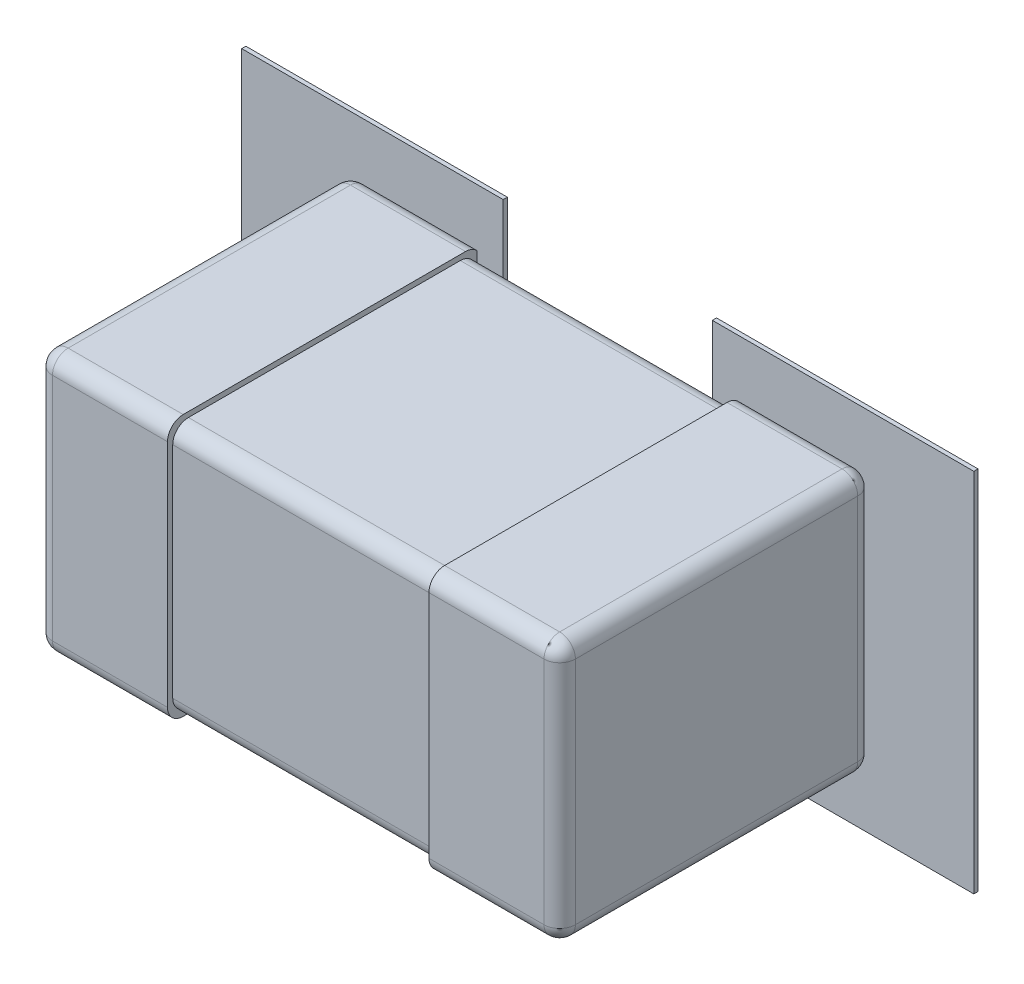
ISO-10303-21;
HEADER;
FILE_DESCRIPTION(('STEP AP214'),'2;1');
FILE_NAME('part.step','',(''),(''),'','','');
FILE_SCHEMA(('AUTOMOTIVE_DESIGN { 1 0 10303 214 1 1 1 1 }'));
ENDSEC;
DATA;
#1=APPLICATION_CONTEXT('core data for automotive mechanical design processes');
#2=APPLICATION_PROTOCOL_DEFINITION('international standard','automotive_design',2000,#1);
#3=PRODUCT_CONTEXT('',#1,'mechanical');
#4=PRODUCT('Part','Part','',(#3));
#5=PRODUCT_RELATED_PRODUCT_CATEGORY('part','',(#4));
#6=PRODUCT_DEFINITION_FORMATION('','',#4);
#7=PRODUCT_DEFINITION_CONTEXT('part definition',#1,'design');
#8=PRODUCT_DEFINITION('design','',#6,#7);
#9=PRODUCT_DEFINITION_SHAPE('','',#8);
#10=(LENGTH_UNIT() NAMED_UNIT(*) SI_UNIT(.MILLI.,.METRE.));
#11=(NAMED_UNIT(*) PLANE_ANGLE_UNIT() SI_UNIT($,.RADIAN.));
#12=(NAMED_UNIT(*) SI_UNIT($,.STERADIAN.) SOLID_ANGLE_UNIT());
#13=UNCERTAINTY_MEASURE_WITH_UNIT(LENGTH_MEASURE(1.E-05),#10,'distance_accuracy_value','');
#14=(GEOMETRIC_REPRESENTATION_CONTEXT(3) GLOBAL_UNCERTAINTY_ASSIGNED_CONTEXT((#13)) GLOBAL_UNIT_ASSIGNED_CONTEXT((#10,
#11,#12)) REPRESENTATION_CONTEXT('',''));
#15=CARTESIAN_POINT('',(0.,0.,0.));
#16=DIRECTION('',(0.,0.,1.));
#17=DIRECTION('',(1.,0.,0.));
#18=AXIS2_PLACEMENT_3D('',#15,#16,#17);
#19=CARTESIAN_POINT('',(0.,0.,0.0762));
#20=DIRECTION('',(0.,0.,1.));
#21=DIRECTION('',(1.,0.,0.));
#22=AXIS2_PLACEMENT_3D('',#19,#20,#21);
#23=PLANE('',#22);
#24=DIRECTION('',(0.,1.,0.));
#25=VECTOR('',#24,1.);
#26=CARTESIAN_POINT('',(0.199999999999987,0.350000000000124,0.0762));
#27=LINE('',#26,#25);
#28=CARTESIAN_POINT('',(0.199999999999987,0.350000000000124,0.0762));
#29=VERTEX_POINT('',#28);
#30=CARTESIAN_POINT('',(0.199999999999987,-0.350000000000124,0.0762));
#31=VERTEX_POINT('',#30);
#32=EDGE_CURVE('E378',#29,#31,#27,.F.);
#33=ORIENTED_EDGE('',*,*,#32,.F.);
#34=DIRECTION('',(1.,0.,0.));
#35=VECTOR('',#34,1.);
#36=CARTESIAN_POINT('',(0.699999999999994,0.350000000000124,0.0762));
#37=LINE('',#36,#35);
#38=CARTESIAN_POINT('',(0.699999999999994,0.350000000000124,0.0762));
#39=VERTEX_POINT('',#38);
#40=EDGE_CURVE('E383',#39,#29,#37,.F.);
#41=ORIENTED_EDGE('',*,*,#40,.F.);
#42=DIRECTION('',(0.,1.,0.));
#43=VECTOR('',#42,1.);
#44=CARTESIAN_POINT('',(0.699999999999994,-0.350000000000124,0.0762));
#45=LINE('',#44,#43);
#46=CARTESIAN_POINT('',(0.699999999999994,-0.350000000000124,0.0762));
#47=VERTEX_POINT('',#46);
#48=EDGE_CURVE('E367',#47,#39,#45,.T.);
#49=ORIENTED_EDGE('',*,*,#48,.F.);
#50=DIRECTION('',(1.,0.,0.));
#51=VECTOR('',#50,1.);
#52=CARTESIAN_POINT('',(0.199999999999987,-0.350000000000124,0.0762));
#53=LINE('',#52,#51);
#54=EDGE_CURVE('E62',#31,#47,#53,.T.);
#55=ORIENTED_EDGE('',*,*,#54,.F.);
#56=EDGE_LOOP('',(#33,#41,#49,#55));
#57=FACE_BOUND('',#56,.T.);
#58=ADVANCED_FACE('F16',(#57),#23,.F.);
#59=CARTESIAN_POINT('',(0.500000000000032,-0.249999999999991,0.0762));
#60=DIRECTION('',(1.,0.,0.));
#61=DIRECTION('',(0.,0.,-1.));
#62=AXIS2_PLACEMENT_3D('',#59,#60,#61);
#63=PLANE('',#62);
#64=DIRECTION('',(0.,0.,-1.));
#65=VECTOR('',#64,1.);
#66=CARTESIAN_POINT('',(0.499999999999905,-0.220000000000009,1.4582402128));
#67=LINE('',#66,#65);
#68=CARTESIAN_POINT('',(0.499999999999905,-0.220000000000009,0.106200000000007));
#69=VERTEX_POINT('',#68);
#70=CARTESIAN_POINT('',(0.499999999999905,-0.220000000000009,0.64614800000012));
#71=VERTEX_POINT('',#70);
#72=EDGE_CURVE('E385',#69,#71,#67,.F.);
#73=ORIENTED_EDGE('',*,*,#72,.F.);
#74=DIRECTION('',(0.,-1.,0.));
#75=VECTOR('',#74,1.);
#76=CARTESIAN_POINT('',(0.499999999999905,1.26251999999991,0.106200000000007));
#77=LINE('',#76,#75);
#78=CARTESIAN_POINT('',(0.499999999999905,0.220000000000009,0.106200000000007));
#79=VERTEX_POINT('',#78);
#80=EDGE_CURVE('E53',#79,#69,#77,.T.);
#81=ORIENTED_EDGE('',*,*,#80,.F.);
#82=DIRECTION('',(0.,0.,-1.));
#83=VECTOR('',#82,1.);
#84=CARTESIAN_POINT('',(0.499999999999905,0.220000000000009,1.4582402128));
#85=LINE('',#84,#83);
#86=CARTESIAN_POINT('',(0.499999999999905,0.220000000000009,0.64614800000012));
#87=VERTEX_POINT('',#86);
#88=EDGE_CURVE('E394',#87,#79,#85,.T.);
#89=ORIENTED_EDGE('',*,*,#88,.F.);
#90=DIRECTION('',(0.,1.,0.));
#91=VECTOR('',#90,1.);
#92=CARTESIAN_POINT('',(0.499999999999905,-1.26251999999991,0.64614800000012));
#93=LINE('',#92,#91);
#94=EDGE_CURVE('E391',#71,#87,#93,.T.);
#95=ORIENTED_EDGE('',*,*,#94,.F.);
#96=EDGE_LOOP('',(#73,#81,#89,#95));
#97=FACE_BOUND('',#96,.T.);
#98=ADVANCED_FACE('F802',(#97),#63,.T.);
#99=CARTESIAN_POINT('',(0.699999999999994,0.350000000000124,0.0762));
#100=DIRECTION('',(0.,1.,0.));
#101=DIRECTION('',(0.,0.,1.));
#102=AXIS2_PLACEMENT_3D('',#99,#100,#101);
#103=PLANE('',#102);
#104=DIRECTION('',(0.,0.,-1.));
#105=VECTOR('',#104,1.);
#106=CARTESIAN_POINT('',(0.699999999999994,0.350000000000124,0.0762));
#107=LINE('',#106,#105);
#108=CARTESIAN_POINT('',(0.699999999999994,0.350000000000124,0.0841999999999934));
#109=VERTEX_POINT('',#108);
#110=EDGE_CURVE('E372',#39,#109,#107,.F.);
#111=ORIENTED_EDGE('',*,*,#110,.F.);
#112=ORIENTED_EDGE('',*,*,#40,.T.);
#113=DIRECTION('',(0.,0.,1.));
#114=VECTOR('',#113,1.);
#115=CARTESIAN_POINT('',(0.199999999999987,0.350000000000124,0.0762));
#116=LINE('',#115,#114);
#117=CARTESIAN_POINT('',(0.199999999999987,0.350000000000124,0.0841999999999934));
#118=VERTEX_POINT('',#117);
#119=EDGE_CURVE('E380',#118,#29,#116,.F.);
#120=ORIENTED_EDGE('',*,*,#119,.F.);
#121=DIRECTION('',(1.,0.,0.));
#122=VECTOR('',#121,1.);
#123=CARTESIAN_POINT('',(0.,0.350000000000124,0.0841999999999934));
#124=LINE('',#123,#122);
#125=EDGE_CURVE('E316',#109,#118,#124,.F.);
#126=ORIENTED_EDGE('',*,*,#125,.F.);
#127=EDGE_LOOP('',(#111,#112,#120,#126));
#128=FACE_BOUND('',#127,.T.);
#129=ADVANCED_FACE('F818',(#128),#103,.T.);
#130=CARTESIAN_POINT('',(0.199999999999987,0.350000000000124,0.0762));
#131=DIRECTION('',(-1.,0.,0.));
#132=DIRECTION('',(0.,0.,1.));
#133=AXIS2_PLACEMENT_3D('',#130,#131,#132);
#134=PLANE('',#133);
#135=ORIENTED_EDGE('',*,*,#119,.T.);
#136=ORIENTED_EDGE('',*,*,#32,.T.);
#137=DIRECTION('',(0.,0.,-1.));
#138=VECTOR('',#137,1.);
#139=CARTESIAN_POINT('',(0.199999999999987,-0.350000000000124,0.0762));
#140=LINE('',#139,#138);
#141=CARTESIAN_POINT('',(0.199999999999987,-0.350000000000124,0.0841999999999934));
#142=VERTEX_POINT('',#141);
#143=EDGE_CURVE('E376',#142,#31,#140,.T.);
#144=ORIENTED_EDGE('',*,*,#143,.F.);
#145=DIRECTION('',(0.,1.,0.));
#146=VECTOR('',#145,1.);
#147=CARTESIAN_POINT('',(0.199999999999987,0.,0.0841999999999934));
#148=LINE('',#147,#146);
#149=EDGE_CURVE('E313',#118,#142,#148,.F.);
#150=ORIENTED_EDGE('',*,*,#149,.F.);
#151=EDGE_LOOP('',(#135,#136,#144,#150));
#152=FACE_BOUND('',#151,.T.);
#153=ADVANCED_FACE('F821',(#152),#134,.T.);
#154=CARTESIAN_POINT('',(0.199999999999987,-0.350000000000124,0.0762));
#155=DIRECTION('',(0.,-1.,0.));
#156=DIRECTION('',(0.,0.,-1.));
#157=AXIS2_PLACEMENT_3D('',#154,#155,#156);
#158=PLANE('',#157);
#159=ORIENTED_EDGE('',*,*,#143,.T.);
#160=ORIENTED_EDGE('',*,*,#54,.T.);
#161=DIRECTION('',(0.,0.,-1.));
#162=VECTOR('',#161,1.);
#163=CARTESIAN_POINT('',(0.699999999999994,-0.350000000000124,0.0762));
#164=LINE('',#163,#162);
#165=CARTESIAN_POINT('',(0.699999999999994,-0.350000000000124,0.0841999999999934));
#166=VERTEX_POINT('',#165);
#167=EDGE_CURVE('E370',#166,#47,#164,.T.);
#168=ORIENTED_EDGE('',*,*,#167,.F.);
#169=DIRECTION('',(1.,0.,0.));
#170=VECTOR('',#169,1.);
#171=CARTESIAN_POINT('',(0.,-0.350000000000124,0.0841999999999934));
#172=LINE('',#171,#170);
#173=EDGE_CURVE('E310',#142,#166,#172,.T.);
#174=ORIENTED_EDGE('',*,*,#173,.F.);
#175=EDGE_LOOP('',(#159,#160,#168,#174));
#176=FACE_BOUND('',#175,.T.);
#177=ADVANCED_FACE('F822',(#176),#158,.T.);
#178=CARTESIAN_POINT('',(0.699999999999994,-0.350000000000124,0.0762));
#179=DIRECTION('',(1.,0.,0.));
#180=DIRECTION('',(0.,0.,-1.));
#181=AXIS2_PLACEMENT_3D('',#178,#179,#180);
#182=PLANE('',#181);
#183=ORIENTED_EDGE('',*,*,#167,.T.);
#184=ORIENTED_EDGE('',*,*,#48,.T.);
#185=ORIENTED_EDGE('',*,*,#110,.T.);
#186=DIRECTION('',(0.,1.,0.));
#187=VECTOR('',#186,1.);
#188=CARTESIAN_POINT('',(0.699999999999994,0.,0.0841999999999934));
#189=LINE('',#188,#187);
#190=EDGE_CURVE('E307',#166,#109,#189,.T.);
#191=ORIENTED_EDGE('',*,*,#190,.F.);
#192=EDGE_LOOP('',(#183,#184,#185,#191));
#193=FACE_BOUND('',#192,.T.);
#194=ADVANCED_FACE('F824',(#193),#182,.T.);
#195=CARTESIAN_POINT('',(0.469999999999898,1.26251999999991,0.106200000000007));
#196=DIRECTION('',(0.,-1.,0.));
#197=DIRECTION('',(0.,0.,-1.));
#198=AXIS2_PLACEMENT_3D('',#195,#196,#197);
#199=CYLINDRICAL_SURFACE('',#198,0.030000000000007);
#200=CARTESIAN_POINT('',(0.469999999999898,-0.220000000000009,0.106200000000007));
#201=DIRECTION('',(0.,-1.,0.));
#202=DIRECTION('',(0.,0.,-1.));
#203=AXIS2_PLACEMENT_3D('',#200,#201,#202);
#204=CIRCLE('',#203,0.030000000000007);
#205=CARTESIAN_POINT('',(0.490396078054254,-0.220000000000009,0.0841999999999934));
#206=VERTEX_POINT('',#205);
#207=EDGE_CURVE('E388',#206,#69,#204,.T.);
#208=ORIENTED_EDGE('',*,*,#207,.F.);
#209=DIRECTION('',(0.,1.,0.));
#210=VECTOR('',#209,1.);
#211=CARTESIAN_POINT('',(0.490396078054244,0.,0.0841999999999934));
#212=LINE('',#211,#210);
#213=CARTESIAN_POINT('',(0.490396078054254,0.220000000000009,0.0841999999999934));
#214=VERTEX_POINT('',#213);
#215=EDGE_CURVE('E303',#214,#206,#212,.F.);
#216=ORIENTED_EDGE('',*,*,#215,.F.);
#217=CARTESIAN_POINT('',(0.469999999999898,0.220000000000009,0.106200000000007));
#218=DIRECTION('',(0.,-1.,0.));
#219=DIRECTION('',(0.,0.,-1.));
#220=AXIS2_PLACEMENT_3D('',#217,#218,#219);
#221=CIRCLE('',#220,0.030000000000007);
#222=EDGE_CURVE('E19',#79,#214,#221,.F.);
#223=ORIENTED_EDGE('',*,*,#222,.F.);
#224=ORIENTED_EDGE('',*,*,#80,.T.);
#225=EDGE_LOOP('',(#208,#216,#223,#224));
#226=FACE_BOUND('',#225,.T.);
#227=ADVANCED_FACE('F359',(#226),#199,.T.);
#228=CARTESIAN_POINT('',(0.469999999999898,0.220000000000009,0.106200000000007));
#229=DIRECTION('',(0.707106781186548,0.707106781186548,0.));
#230=DIRECTION('',(0.,0.,-1.));
#231=AXIS2_PLACEMENT_3D('',#228,#229,#230);
#232=SPHERICAL_SURFACE('',#231,0.030000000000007);
#233=ORIENTED_EDGE('',*,*,#222,.T.);
#234=CARTESIAN_POINT('',(0.469999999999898,0.240396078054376,0.0841999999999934));
#235=CARTESIAN_POINT('',(0.472298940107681,0.240411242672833,0.0841999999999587));
#236=CARTESIAN_POINT('',(0.474588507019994,0.240009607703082,0.0841999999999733));
#237=CARTESIAN_POINT('',(0.478913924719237,0.238483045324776,0.0842000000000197));
#238=CARTESIAN_POINT('',(0.480949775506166,0.237358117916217,0.0842000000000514));
#239=CARTESIAN_POINT('',(0.484532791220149,0.234495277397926,0.0842000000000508));
#240=CARTESIAN_POINT('',(0.486079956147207,0.2327573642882,0.0842000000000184));
#241=CARTESIAN_POINT('',(0.48850977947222,0.228865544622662,0.0842000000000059));
#242=CARTESIAN_POINT('',(0.489392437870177,0.226711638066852,0.0842000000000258));
#243=CARTESIAN_POINT('',(0.490231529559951,0.223007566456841,0.0842000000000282));
#244=CARTESIAN_POINT('',(0.490401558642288,0.221503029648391,0.0842000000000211));
#245=CARTESIAN_POINT('',(0.490396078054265,0.220000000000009,0.0841999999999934));
#246=B_SPLINE_CURVE_WITH_KNOTS('',3,(#234,#235,#236,#237,#238,#239,#240,#241,#242,#243,#244,
#245),.UNSPECIFIED.,.F.,.F.,(4,2,2,2,2,4),(0.,0.00684841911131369,0.0136968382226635,
0.0205452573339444,0.0273936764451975,0.0318985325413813),.UNSPECIFIED.);
#247=CARTESIAN_POINT('',(0.469999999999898,0.240396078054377,0.0841999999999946));
#248=VERTEX_POINT('',#247);
#249=EDGE_CURVE('E306',#248,#214,#246,.T.);
#250=ORIENTED_EDGE('',*,*,#249,.F.);
#251=CARTESIAN_POINT('',(0.469999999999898,0.220000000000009,0.106200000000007));
#252=DIRECTION('',(1.,0.,0.));
#253=DIRECTION('',(0.,0.,-1.));
#254=AXIS2_PLACEMENT_3D('',#251,#252,#253);
#255=CIRCLE('',#254,0.030000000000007);
#256=CARTESIAN_POINT('',(0.469999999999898,0.250000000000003,0.106200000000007));
#257=VERTEX_POINT('',#256);
#258=EDGE_CURVE('E302',#257,#248,#255,.F.);
#259=ORIENTED_EDGE('',*,*,#258,.F.);
#260=CARTESIAN_POINT('',(0.469999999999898,0.220000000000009,0.106200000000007));
#261=DIRECTION('',(0.,0.,-1.));
#262=DIRECTION('',(-1.,0.,0.));
#263=AXIS2_PLACEMENT_3D('',#260,#261,#262);
#264=CIRCLE('',#263,0.030000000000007);
#265=CARTESIAN_POINT('',(0.491213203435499,0.24121320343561,0.106200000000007));
#266=VERTEX_POINT('',#265);
#267=EDGE_CURVE('E269',#266,#257,#264,.F.);
#268=ORIENTED_EDGE('',*,*,#267,.F.);
#269=CARTESIAN_POINT('',(0.469999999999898,0.220000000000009,0.106200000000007));
#270=DIRECTION('',(0.,0.,-1.));
#271=DIRECTION('',(-1.,0.,0.));
#272=AXIS2_PLACEMENT_3D('',#269,#270,#271);
#273=CIRCLE('',#272,0.030000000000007);
#274=EDGE_CURVE('E34',#79,#266,#273,.F.);
#275=ORIENTED_EDGE('',*,*,#274,.F.);
#276=EDGE_LOOP('',(#233,#250,#259,#268,#275));
#277=FACE_BOUND('',#276,.T.);
#278=ADVANCED_FACE('F353',(#277),#232,.T.);
#279=CARTESIAN_POINT('',(0.469999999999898,0.220000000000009,1.4582402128));
#280=DIRECTION('',(0.,0.,-1.));
#281=DIRECTION('',(-1.,0.,0.));
#282=AXIS2_PLACEMENT_3D('',#279,#280,#281);
#283=CYLINDRICAL_SURFACE('',#282,0.030000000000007);
#284=ORIENTED_EDGE('',*,*,#267,.T.);
#285=DIRECTION('',(0.,0.,1.));
#286=VECTOR('',#285,1.);
#287=CARTESIAN_POINT('',(0.469999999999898,0.249999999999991,0.0762));
#288=LINE('',#287,#286);
#289=CARTESIAN_POINT('',(0.469999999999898,0.250000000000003,0.64614800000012));
#290=VERTEX_POINT('',#289);
#291=EDGE_CURVE('E281',#290,#257,#288,.F.);
#292=ORIENTED_EDGE('',*,*,#291,.F.);
#293=CARTESIAN_POINT('',(0.469999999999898,0.220000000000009,0.64614800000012));
#294=DIRECTION('',(0.,0.,-1.));
#295=DIRECTION('',(-1.,0.,0.));
#296=AXIS2_PLACEMENT_3D('',#293,#294,#295);
#297=CIRCLE('',#296,0.030000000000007);
#298=EDGE_CURVE('E264',#87,#290,#297,.F.);
#299=ORIENTED_EDGE('',*,*,#298,.F.);
#300=ORIENTED_EDGE('',*,*,#88,.T.);
#301=ORIENTED_EDGE('',*,*,#274,.T.);
#302=EDGE_LOOP('',(#284,#292,#299,#300,#301));
#303=FACE_BOUND('',#302,.T.);
#304=ADVANCED_FACE('F282',(#303),#283,.T.);
#305=CARTESIAN_POINT('',(0.469999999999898,0.220000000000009,0.64614800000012));
#306=DIRECTION('',(0.,0.707106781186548,0.707106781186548));
#307=DIRECTION('',(1.,0.,0.));
#308=AXIS2_PLACEMENT_3D('',#305,#306,#307);
#309=SPHERICAL_SURFACE('',#308,0.030000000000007);
#310=CARTESIAN_POINT('',(0.469999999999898,0.220000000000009,0.64614800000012));
#311=DIRECTION('',(0.,1.,0.));
#312=DIRECTION('',(0.,0.,1.));
#313=AXIS2_PLACEMENT_3D('',#310,#311,#312);
#314=CIRCLE('',#313,0.030000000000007);
#315=CARTESIAN_POINT('',(0.469999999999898,0.220000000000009,0.676148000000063));
#316=VERTEX_POINT('',#315);
#317=EDGE_CURVE('E258',#87,#316,#314,.F.);
#318=ORIENTED_EDGE('',*,*,#317,.F.);
#319=ORIENTED_EDGE('',*,*,#298,.T.);
#320=CARTESIAN_POINT('',(0.469999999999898,0.220000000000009,0.64614800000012));
#321=DIRECTION('',(-1.,0.,0.));
#322=DIRECTION('',(0.,0.,1.));
#323=AXIS2_PLACEMENT_3D('',#320,#321,#322);
#324=CIRCLE('',#323,0.030000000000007);
#325=CARTESIAN_POINT('',(0.469999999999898,0.24121320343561,0.667361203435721));
#326=VERTEX_POINT('',#325);
#327=EDGE_CURVE('E267',#326,#290,#324,.T.);
#328=ORIENTED_EDGE('',*,*,#327,.F.);
#329=CARTESIAN_POINT('',(0.469999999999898,0.220000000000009,0.64614800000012));
#330=DIRECTION('',(-1.,0.,0.));
#331=DIRECTION('',(0.,0.,1.));
#332=AXIS2_PLACEMENT_3D('',#329,#330,#331);
#333=CIRCLE('',#332,0.030000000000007);
#334=EDGE_CURVE('E278',#316,#326,#333,.T.);
#335=ORIENTED_EDGE('',*,*,#334,.F.);
#336=EDGE_LOOP('',(#318,#319,#328,#335));
#337=FACE_BOUND('',#336,.T.);
#338=ADVANCED_FACE('F266',(#337),#309,.T.);
#339=CARTESIAN_POINT('',(0.469999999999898,-1.26251999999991,0.64614800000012));
#340=DIRECTION('',(0.,1.,0.));
#341=DIRECTION('',(0.,0.,1.));
#342=AXIS2_PLACEMENT_3D('',#339,#340,#341);
#343=CYLINDRICAL_SURFACE('',#342,0.030000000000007);
#344=CARTESIAN_POINT('',(0.469999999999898,-0.220000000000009,0.64614800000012));
#345=DIRECTION('',(0.,1.,0.));
#346=DIRECTION('',(0.,0.,1.));
#347=AXIS2_PLACEMENT_3D('',#344,#345,#346);
#348=CIRCLE('',#347,0.030000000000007);
#349=CARTESIAN_POINT('',(0.491213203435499,-0.220000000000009,0.667361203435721));
#350=VERTEX_POINT('',#349);
#351=EDGE_CURVE('E393',#71,#350,#348,.F.);
#352=ORIENTED_EDGE('',*,*,#351,.F.);
#353=ORIENTED_EDGE('',*,*,#94,.T.);
#354=ORIENTED_EDGE('',*,*,#317,.T.);
#355=DIRECTION('',(0.,1.,0.));
#356=VECTOR('',#355,1.);
#357=CARTESIAN_POINT('',(0.469999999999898,0.,0.676148));
#358=LINE('',#357,#356);
#359=CARTESIAN_POINT('',(0.469999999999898,-0.220000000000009,0.676148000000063));
#360=VERTEX_POINT('',#359);
#361=EDGE_CURVE('E292',#360,#316,#358,.T.);
#362=ORIENTED_EDGE('',*,*,#361,.F.);
#363=CARTESIAN_POINT('',(0.469999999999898,-0.220000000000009,0.64614800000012));
#364=DIRECTION('',(0.,-1.,0.));
#365=DIRECTION('',(0.707106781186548,0.,0.707106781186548));
#366=AXIS2_PLACEMENT_3D('',#363,#364,#365);
#367=CIRCLE('',#366,0.030000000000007);
#368=EDGE_CURVE('E777',#350,#360,#367,.T.);
#369=ORIENTED_EDGE('',*,*,#368,.F.);
#370=EDGE_LOOP('',(#352,#353,#354,#362,#369));
#371=FACE_BOUND('',#370,.T.);
#372=ADVANCED_FACE('F788',(#371),#343,.T.);
#373=CARTESIAN_POINT('',(0.469999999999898,-0.220000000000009,0.64614800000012));
#374=DIRECTION('',(0.707106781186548,0.,0.707106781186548));
#375=DIRECTION('',(0.,-1.,0.));
#376=AXIS2_PLACEMENT_3D('',#373,#374,#375);
#377=SPHERICAL_SURFACE('',#376,0.030000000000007);
#378=ORIENTED_EDGE('',*,*,#351,.T.);
#379=ORIENTED_EDGE('',*,*,#368,.T.);
#380=CARTESIAN_POINT('',(0.469999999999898,-0.220000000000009,0.64614800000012));
#381=DIRECTION('',(1.,0.,0.));
#382=DIRECTION('',(0.,0.,-1.));
#383=AXIS2_PLACEMENT_3D('',#380,#381,#382);
#384=CIRCLE('',#383,0.030000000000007);
#385=CARTESIAN_POINT('',(0.469999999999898,-0.250000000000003,0.64614800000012));
#386=VERTEX_POINT('',#385);
#387=EDGE_CURVE('E760',#386,#360,#384,.F.);
#388=ORIENTED_EDGE('',*,*,#387,.F.);
#389=CARTESIAN_POINT('',(0.469999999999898,-0.220000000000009,0.64614800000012));
#390=DIRECTION('',(0.,0.,-1.));
#391=DIRECTION('',(-1.,0.,0.));
#392=AXIS2_PLACEMENT_3D('',#389,#390,#391);
#393=CIRCLE('',#392,0.030000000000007);
#394=EDGE_CURVE('E389',#71,#386,#393,.T.);
#395=ORIENTED_EDGE('',*,*,#394,.F.);
#396=EDGE_LOOP('',(#378,#379,#388,#395));
#397=FACE_BOUND('',#396,.T.);
#398=ADVANCED_FACE('F775',(#397),#377,.T.);
#399=CARTESIAN_POINT('',(0.469999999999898,-0.220000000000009,1.4582402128));
#400=DIRECTION('',(0.,0.,-1.));
#401=DIRECTION('',(-1.,0.,0.));
#402=AXIS2_PLACEMENT_3D('',#399,#400,#401);
#403=CYLINDRICAL_SURFACE('',#402,0.030000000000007);
#404=CARTESIAN_POINT('',(0.469999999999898,-0.220000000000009,0.106200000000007));
#405=DIRECTION('',(0.,0.,-1.));
#406=DIRECTION('',(-1.,0.,0.));
#407=AXIS2_PLACEMENT_3D('',#404,#405,#406);
#408=CIRCLE('',#407,0.030000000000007);
#409=CARTESIAN_POINT('',(0.491213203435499,-0.24121320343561,0.106200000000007));
#410=VERTEX_POINT('',#409);
#411=EDGE_CURVE('E351',#69,#410,#408,.T.);
#412=ORIENTED_EDGE('',*,*,#411,.F.);
#413=ORIENTED_EDGE('',*,*,#72,.T.);
#414=ORIENTED_EDGE('',*,*,#394,.T.);
#415=DIRECTION('',(0.,0.,-1.));
#416=VECTOR('',#415,1.);
#417=CARTESIAN_POINT('',(0.469999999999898,-0.249999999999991,0.0762));
#418=LINE('',#417,#416);
#419=CARTESIAN_POINT('',(0.469999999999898,-0.250000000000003,0.106200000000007));
#420=VERTEX_POINT('',#419);
#421=EDGE_CURVE('E320',#420,#386,#418,.F.);
#422=ORIENTED_EDGE('',*,*,#421,.F.);
#423=CARTESIAN_POINT('',(0.469999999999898,-0.220000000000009,0.106200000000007));
#424=DIRECTION('',(0.,0.,-1.));
#425=DIRECTION('',(0.707106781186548,-0.707106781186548,0.));
#426=AXIS2_PLACEMENT_3D('',#423,#424,#425);
#427=CIRCLE('',#426,0.030000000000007);
#428=EDGE_CURVE('E319',#410,#420,#427,.T.);
#429=ORIENTED_EDGE('',*,*,#428,.F.);
#430=EDGE_LOOP('',(#412,#413,#414,#422,#429));
#431=FACE_BOUND('',#430,.T.);
#432=ADVANCED_FACE('F334',(#431),#403,.T.);
#433=CARTESIAN_POINT('',(0.469999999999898,-0.220000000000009,0.106200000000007));
#434=DIRECTION('',(0.707106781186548,-0.707106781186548,0.));
#435=DIRECTION('',(0.,0.,-1.));
#436=AXIS2_PLACEMENT_3D('',#433,#434,#435);
#437=SPHERICAL_SURFACE('',#436,0.030000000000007);
#438=CARTESIAN_POINT('',(0.469999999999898,-0.220000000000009,0.106200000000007));
#439=DIRECTION('',(-1.,0.,0.));
#440=DIRECTION('',(0.,0.,1.));
#441=AXIS2_PLACEMENT_3D('',#438,#439,#440);
#442=CIRCLE('',#441,0.030000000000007);
#443=CARTESIAN_POINT('',(0.469999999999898,-0.240396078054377,0.0841999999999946));
#444=VERTEX_POINT('',#443);
#445=EDGE_CURVE('E756',#444,#420,#442,.T.);
#446=ORIENTED_EDGE('',*,*,#445,.F.);
#447=CARTESIAN_POINT('',(0.490396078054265,-0.220000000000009,0.0841999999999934));
#448=CARTESIAN_POINT('',(0.490411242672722,-0.222298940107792,0.0841999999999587));
#449=CARTESIAN_POINT('',(0.490009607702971,-0.224588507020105,0.0841999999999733));
#450=CARTESIAN_POINT('',(0.488483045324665,-0.228913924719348,0.0842000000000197));
#451=CARTESIAN_POINT('',(0.487358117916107,-0.230949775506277,0.0842000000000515));
#452=CARTESIAN_POINT('',(0.484495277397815,-0.234532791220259,0.0842000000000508));
#453=CARTESIAN_POINT('',(0.482757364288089,-0.236079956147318,0.0842000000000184));
#454=CARTESIAN_POINT('',(0.478865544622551,-0.238509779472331,0.0842000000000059));
#455=CARTESIAN_POINT('',(0.476711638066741,-0.239392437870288,0.0842000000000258));
#456=CARTESIAN_POINT('',(0.47300756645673,-0.240231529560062,0.0842000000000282));
#457=CARTESIAN_POINT('',(0.47150302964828,-0.240401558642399,0.0842000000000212));
#458=CARTESIAN_POINT('',(0.469999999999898,-0.240396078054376,0.0841999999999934));
#459=B_SPLINE_CURVE_WITH_KNOTS('',3,(#447,#448,#449,#450,#451,#452,#453,#454,#455,#456,#457,
#458),.UNSPECIFIED.,.F.,.F.,(4,2,2,2,2,4),(0.,0.00684841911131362,0.0136968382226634,
0.0205452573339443,0.0273936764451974,0.0318985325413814),.UNSPECIFIED.);
#460=EDGE_CURVE('E305',#206,#444,#459,.T.);
#461=ORIENTED_EDGE('',*,*,#460,.F.);
#462=ORIENTED_EDGE('',*,*,#207,.T.);
#463=ORIENTED_EDGE('',*,*,#411,.T.);
#464=ORIENTED_EDGE('',*,*,#428,.T.);
#465=EDGE_LOOP('',(#446,#461,#462,#463,#464));
#466=FACE_BOUND('',#465,.T.);
#467=ADVANCED_FACE('F328',(#466),#437,.T.);
#468=CARTESIAN_POINT('',(0.,0.,0.0841999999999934));
#469=DIRECTION('',(0.,0.,1.));
#470=DIRECTION('',(1.,0.,0.));
#471=AXIS2_PLACEMENT_3D('',#468,#469,#470);
#472=PLANE('',#471);
#473=DIRECTION('',(-1.,0.,0.));
#474=VECTOR('',#473,1.);
#475=CARTESIAN_POINT('',(2.52504000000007,-0.240396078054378,0.0841999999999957));
#476=LINE('',#475,#474);
#477=CARTESIAN_POINT('',(0.249999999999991,-0.240396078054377,0.0841999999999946));
#478=VERTEX_POINT('',#477);
#479=EDGE_CURVE('E686',#478,#444,#476,.F.);
#480=ORIENTED_EDGE('',*,*,#479,.F.);
#481=DIRECTION('',(0.,1.,0.));
#482=VECTOR('',#481,1.);
#483=CARTESIAN_POINT('',(0.249999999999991,-0.249999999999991,0.0841999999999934));
#484=LINE('',#483,#482);
#485=CARTESIAN_POINT('',(0.249999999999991,0.240396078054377,0.0841999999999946));
#486=VERTEX_POINT('',#485);
#487=EDGE_CURVE('E684',#478,#486,#484,.T.);
#488=ORIENTED_EDGE('',*,*,#487,.T.);
#489=DIRECTION('',(1.,0.,0.));
#490=VECTOR('',#489,1.);
#491=CARTESIAN_POINT('',(-2.52504000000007,0.240396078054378,0.0841999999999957));
#492=LINE('',#491,#490);
#493=EDGE_CURVE('E286',#248,#486,#492,.F.);
#494=ORIENTED_EDGE('',*,*,#493,.F.);
#495=ORIENTED_EDGE('',*,*,#249,.T.);
#496=ORIENTED_EDGE('',*,*,#215,.T.);
#497=ORIENTED_EDGE('',*,*,#460,.T.);
#498=EDGE_LOOP('',(#480,#488,#494,#495,#496,#497));
#499=FACE_BOUND('',#498,.T.);
#500=ORIENTED_EDGE('',*,*,#173,.T.);
#501=ORIENTED_EDGE('',*,*,#190,.T.);
#502=ORIENTED_EDGE('',*,*,#125,.T.);
#503=ORIENTED_EDGE('',*,*,#149,.T.);
#504=EDGE_LOOP('',(#500,#501,#502,#503));
#505=FACE_BOUND('',#504,.T.);
#506=ADVANCED_FACE('F333',(#499,#505),#472,.T.);
#507=CARTESIAN_POINT('',(-2.52504000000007,0.220000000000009,0.106200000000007));
#508=DIRECTION('',(1.,0.,0.));
#509=DIRECTION('',(0.,0.,-1.));
#510=AXIS2_PLACEMENT_3D('',#507,#508,#509);
#511=CYLINDRICAL_SURFACE('',#510,0.030000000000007);
#512=ORIENTED_EDGE('',*,*,#258,.T.);
#513=ORIENTED_EDGE('',*,*,#493,.T.);
#514=CARTESIAN_POINT('',(0.249999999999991,0.220000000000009,0.106200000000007));
#515=DIRECTION('',(1.,0.,0.));
#516=DIRECTION('',(0.,0.,-1.));
#517=AXIS2_PLACEMENT_3D('',#514,#515,#516);
#518=CIRCLE('',#517,0.030000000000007);
#519=CARTESIAN_POINT('',(0.249999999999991,0.249999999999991,0.106200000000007));
#520=VERTEX_POINT('',#519);
#521=EDGE_CURVE('E690',#486,#520,#518,.T.);
#522=ORIENTED_EDGE('',*,*,#521,.T.);
#523=DIRECTION('',(1.,0.,0.));
#524=VECTOR('',#523,1.);
#525=CARTESIAN_POINT('',(0.500000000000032,0.249999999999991,0.106200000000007));
#526=LINE('',#525,#524);
#527=EDGE_CURVE('E285',#257,#520,#526,.F.);
#528=ORIENTED_EDGE('',*,*,#527,.F.);
#529=EDGE_LOOP('',(#512,#513,#522,#528));
#530=FACE_BOUND('',#529,.T.);
#531=ADVANCED_FACE('F666',(#530),#511,.T.);
#532=CARTESIAN_POINT('',(0.500000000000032,0.249999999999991,0.0762));
#533=DIRECTION('',(0.,1.,0.));
#534=DIRECTION('',(0.,0.,1.));
#535=AXIS2_PLACEMENT_3D('',#532,#533,#534);
#536=PLANE('',#535);
#537=DIRECTION('',(0.,0.,-1.));
#538=VECTOR('',#537,1.);
#539=CARTESIAN_POINT('',(0.249999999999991,0.249999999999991,0.0862000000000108));
#540=LINE('',#539,#538);
#541=CARTESIAN_POINT('',(0.249999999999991,0.250000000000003,0.64614800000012));
#542=VERTEX_POINT('',#541);
#543=EDGE_CURVE('E291',#520,#542,#540,.F.);
#544=ORIENTED_EDGE('',*,*,#543,.T.);
#545=DIRECTION('',(-1.,0.,0.));
#546=VECTOR('',#545,1.);
#547=CARTESIAN_POINT('',(2.52504000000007,0.250000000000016,0.64614800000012));
#548=LINE('',#547,#546);
#549=EDGE_CURVE('E275',#290,#542,#548,.T.);
#550=ORIENTED_EDGE('',*,*,#549,.F.);
#551=ORIENTED_EDGE('',*,*,#291,.T.);
#552=ORIENTED_EDGE('',*,*,#527,.T.);
#553=EDGE_LOOP('',(#544,#550,#551,#552));
#554=FACE_BOUND('',#553,.T.);
#555=ADVANCED_FACE('F289',(#554),#536,.T.);
#556=CARTESIAN_POINT('',(2.52504000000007,0.220000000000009,0.64614800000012));
#557=DIRECTION('',(-1.,0.,0.));
#558=DIRECTION('',(0.,0.,1.));
#559=AXIS2_PLACEMENT_3D('',#556,#557,#558);
#560=CYLINDRICAL_SURFACE('',#559,0.030000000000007);
#561=ORIENTED_EDGE('',*,*,#549,.T.);
#562=CARTESIAN_POINT('',(0.249999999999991,0.220000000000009,0.64614800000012));
#563=DIRECTION('',(-1.,0.,0.));
#564=DIRECTION('',(0.,0.,1.));
#565=AXIS2_PLACEMENT_3D('',#562,#563,#564);
#566=CIRCLE('',#565,0.030000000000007);
#567=CARTESIAN_POINT('',(0.249999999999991,0.220000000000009,0.676148));
#568=VERTEX_POINT('',#567);
#569=EDGE_CURVE('E747',#542,#568,#566,.F.);
#570=ORIENTED_EDGE('',*,*,#569,.T.);
#571=DIRECTION('',(1.,0.,0.));
#572=VECTOR('',#571,1.);
#573=CARTESIAN_POINT('',(0.,0.220000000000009,0.676148));
#574=LINE('',#573,#572);
#575=EDGE_CURVE('E295',#316,#568,#574,.F.);
#576=ORIENTED_EDGE('',*,*,#575,.F.);
#577=ORIENTED_EDGE('',*,*,#334,.T.);
#578=ORIENTED_EDGE('',*,*,#327,.T.);
#579=EDGE_LOOP('',(#561,#570,#576,#577,#578));
#580=FACE_BOUND('',#579,.T.);
#581=ADVANCED_FACE('F272',(#580),#560,.T.);
#582=CARTESIAN_POINT('',(0.,0.,0.676148));
#583=DIRECTION('',(0.,0.,1.));
#584=DIRECTION('',(1.,0.,0.));
#585=AXIS2_PLACEMENT_3D('',#582,#583,#584);
#586=PLANE('',#585);
#587=DIRECTION('',(0.,1.,0.));
#588=VECTOR('',#587,1.);
#589=CARTESIAN_POINT('',(0.249999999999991,-0.249999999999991,0.676148));
#590=LINE('',#589,#588);
#591=CARTESIAN_POINT('',(0.249999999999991,-0.220000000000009,0.676148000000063));
#592=VERTEX_POINT('',#591);
#593=EDGE_CURVE('E745',#568,#592,#590,.F.);
#594=ORIENTED_EDGE('',*,*,#593,.T.);
#595=DIRECTION('',(1.,0.,0.));
#596=VECTOR('',#595,1.);
#597=CARTESIAN_POINT('',(-2.52504000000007,-0.220000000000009,0.676148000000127));
#598=LINE('',#597,#596);
#599=EDGE_CURVE('E324',#360,#592,#598,.F.);
#600=ORIENTED_EDGE('',*,*,#599,.F.);
#601=ORIENTED_EDGE('',*,*,#361,.T.);
#602=ORIENTED_EDGE('',*,*,#575,.T.);
#603=EDGE_LOOP('',(#594,#600,#601,#602));
#604=FACE_BOUND('',#603,.T.);
#605=ADVANCED_FACE('F658',(#604),#586,.T.);
#606=CARTESIAN_POINT('',(-2.52504000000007,-0.220000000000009,0.64614800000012));
#607=DIRECTION('',(1.,0.,0.));
#608=DIRECTION('',(0.,0.,-1.));
#609=AXIS2_PLACEMENT_3D('',#606,#607,#608);
#610=CYLINDRICAL_SURFACE('',#609,0.030000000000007);
#611=ORIENTED_EDGE('',*,*,#599,.T.);
#612=CARTESIAN_POINT('',(0.249999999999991,-0.220000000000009,0.64614800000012));
#613=DIRECTION('',(1.,0.,0.));
#614=DIRECTION('',(0.,0.,-1.));
#615=AXIS2_PLACEMENT_3D('',#612,#613,#614);
#616=CIRCLE('',#615,0.030000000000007);
#617=CARTESIAN_POINT('',(0.249999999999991,-0.249999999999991,0.64614800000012));
#618=VERTEX_POINT('',#617);
#619=EDGE_CURVE('E744',#592,#618,#616,.T.);
#620=ORIENTED_EDGE('',*,*,#619,.T.);
#621=DIRECTION('',(1.,0.,0.));
#622=VECTOR('',#621,1.);
#623=CARTESIAN_POINT('',(-0.500000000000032,-0.249999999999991,0.64614800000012));
#624=LINE('',#623,#622);
#625=EDGE_CURVE('E323',#386,#618,#624,.F.);
#626=ORIENTED_EDGE('',*,*,#625,.F.);
#627=ORIENTED_EDGE('',*,*,#387,.T.);
#628=EDGE_LOOP('',(#611,#620,#626,#627));
#629=FACE_BOUND('',#628,.T.);
#630=ADVANCED_FACE('F654',(#629),#610,.T.);
#631=CARTESIAN_POINT('',(-0.500000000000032,-0.249999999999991,0.0762));
#632=DIRECTION('',(0.,-1.,0.));
#633=DIRECTION('',(0.,0.,-1.));
#634=AXIS2_PLACEMENT_3D('',#631,#632,#633);
#635=PLANE('',#634);
#636=ORIENTED_EDGE('',*,*,#421,.T.);
#637=ORIENTED_EDGE('',*,*,#625,.T.);
#638=DIRECTION('',(0.,0.,-1.));
#639=VECTOR('',#638,1.);
#640=CARTESIAN_POINT('',(0.249999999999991,-0.249999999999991,0.0862000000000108));
#641=LINE('',#640,#639);
#642=CARTESIAN_POINT('',(0.249999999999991,-0.250000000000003,0.106200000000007));
#643=VERTEX_POINT('',#642);
#644=EDGE_CURVE('E742',#618,#643,#641,.T.);
#645=ORIENTED_EDGE('',*,*,#644,.T.);
#646=DIRECTION('',(-1.,0.,0.));
#647=VECTOR('',#646,1.);
#648=CARTESIAN_POINT('',(2.52504000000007,-0.250000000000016,0.106200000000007));
#649=LINE('',#648,#647);
#650=EDGE_CURVE('E759',#420,#643,#649,.T.);
#651=ORIENTED_EDGE('',*,*,#650,.F.);
#652=EDGE_LOOP('',(#636,#637,#645,#651));
#653=FACE_BOUND('',#652,.T.);
#654=ADVANCED_FACE('F650',(#653),#635,.T.);
#655=CARTESIAN_POINT('',(2.52504000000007,-0.220000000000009,0.106200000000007));
#656=DIRECTION('',(-1.,0.,0.));
#657=DIRECTION('',(0.,0.,1.));
#658=AXIS2_PLACEMENT_3D('',#655,#656,#657);
#659=CYLINDRICAL_SURFACE('',#658,0.030000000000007);
#660=CARTESIAN_POINT('',(0.249999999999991,-0.220000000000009,0.106200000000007));
#661=DIRECTION('',(-1.,0.,0.));
#662=DIRECTION('',(0.,0.,1.));
#663=AXIS2_PLACEMENT_3D('',#660,#661,#662);
#664=CIRCLE('',#663,0.030000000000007);
#665=EDGE_CURVE('E730',#643,#478,#664,.F.);
#666=ORIENTED_EDGE('',*,*,#665,.T.);
#667=ORIENTED_EDGE('',*,*,#479,.T.);
#668=ORIENTED_EDGE('',*,*,#445,.T.);
#669=ORIENTED_EDGE('',*,*,#650,.T.);
#670=EDGE_LOOP('',(#666,#667,#668,#669));
#671=FACE_BOUND('',#670,.T.);
#672=ADVANCED_FACE('F646',(#671),#659,.T.);
#673=CARTESIAN_POINT('',(-0.469999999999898,-0.220000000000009,0.64614800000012));
#674=DIRECTION('',(0.,-0.707106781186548,0.707106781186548));
#675=DIRECTION('',(-1.,0.,0.));
#676=AXIS2_PLACEMENT_3D('',#673,#674,#675);
#677=SPHERICAL_SURFACE('',#676,0.030000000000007);
#678=CARTESIAN_POINT('',(-0.469999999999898,-0.220000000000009,0.64614800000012));
#679=DIRECTION('',(0.,-1.,0.));
#680=DIRECTION('',(0.,0.,-1.));
#681=AXIS2_PLACEMENT_3D('',#678,#679,#680);
#682=CIRCLE('',#681,0.030000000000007);
#683=CARTESIAN_POINT('',(-0.499999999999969,-0.220000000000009,0.64614800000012));
#684=VERTEX_POINT('',#683);
#685=CARTESIAN_POINT('',(-0.469999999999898,-0.220000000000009,0.676148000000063));
#686=VERTEX_POINT('',#685);
#687=EDGE_CURVE('E694',#684,#686,#682,.F.);
#688=ORIENTED_EDGE('',*,*,#687,.F.);
#689=CARTESIAN_POINT('',(-0.469999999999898,-0.220000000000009,0.64614800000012));
#690=DIRECTION('',(0.,0.,-1.));
#691=DIRECTION('',(-1.,0.,0.));
#692=AXIS2_PLACEMENT_3D('',#689,#690,#691);
#693=CIRCLE('',#692,0.030000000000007);
#694=CARTESIAN_POINT('',(-0.469999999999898,-0.250000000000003,0.64614800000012));
#695=VERTEX_POINT('',#694);
#696=EDGE_CURVE('E725',#695,#684,#693,.T.);
#697=ORIENTED_EDGE('',*,*,#696,.F.);
#698=CARTESIAN_POINT('',(-0.469999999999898,-0.220000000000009,0.64614800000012));
#699=DIRECTION('',(1.,0.,0.));
#700=DIRECTION('',(0.,0.,-1.));
#701=AXIS2_PLACEMENT_3D('',#698,#699,#700);
#702=CIRCLE('',#701,0.030000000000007);
#703=CARTESIAN_POINT('',(-0.469999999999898,-0.24121320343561,0.667361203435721));
#704=VERTEX_POINT('',#703);
#705=EDGE_CURVE('E637',#704,#695,#702,.T.);
#706=ORIENTED_EDGE('',*,*,#705,.F.);
#707=CARTESIAN_POINT('',(-0.469999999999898,-0.220000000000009,0.64614800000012));
#708=DIRECTION('',(1.,0.,0.));
#709=DIRECTION('',(0.,0.,-1.));
#710=AXIS2_PLACEMENT_3D('',#707,#708,#709);
#711=CIRCLE('',#710,0.030000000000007);
#712=EDGE_CURVE('E635',#686,#704,#711,.T.);
#713=ORIENTED_EDGE('',*,*,#712,.F.);
#714=EDGE_LOOP('',(#688,#697,#706,#713));
#715=FACE_BOUND('',#714,.T.);
#716=ADVANCED_FACE('F643',(#715),#677,.T.);
#717=CARTESIAN_POINT('',(-0.469999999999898,1.26251999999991,0.64614800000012));
#718=DIRECTION('',(0.,-1.,0.));
#719=DIRECTION('',(0.,0.,-1.));
#720=AXIS2_PLACEMENT_3D('',#717,#718,#719);
#721=CYLINDRICAL_SURFACE('',#720,0.030000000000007);
#722=CARTESIAN_POINT('',(-0.469999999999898,0.220000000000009,0.64614800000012));
#723=DIRECTION('',(0.,-1.,0.));
#724=DIRECTION('',(0.,0.,-1.));
#725=AXIS2_PLACEMENT_3D('',#722,#723,#724);
#726=CIRCLE('',#725,0.030000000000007);
#727=CARTESIAN_POINT('',(-0.499999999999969,0.220000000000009,0.64614800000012));
#728=VERTEX_POINT('',#727);
#729=CARTESIAN_POINT('',(-0.469999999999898,0.220000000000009,0.676148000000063));
#730=VERTEX_POINT('',#729);
#731=EDGE_CURVE('E691',#728,#730,#726,.F.);
#732=ORIENTED_EDGE('',*,*,#731,.F.);
#733=DIRECTION('',(0.,1.,0.));
#734=VECTOR('',#733,1.);
#735=CARTESIAN_POINT('',(-0.500000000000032,0.249999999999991,0.64614800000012));
#736=LINE('',#735,#734);
#737=EDGE_CURVE('E641',#684,#728,#736,.T.);
#738=ORIENTED_EDGE('',*,*,#737,.F.);
#739=ORIENTED_EDGE('',*,*,#687,.T.);
#740=DIRECTION('',(0.,1.,0.));
#741=VECTOR('',#740,1.);
#742=CARTESIAN_POINT('',(-0.469999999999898,0.,0.676148));
#743=LINE('',#742,#741);
#744=EDGE_CURVE('E633',#730,#686,#743,.F.);
#745=ORIENTED_EDGE('',*,*,#744,.F.);
#746=EDGE_LOOP('',(#732,#738,#739,#745));
#747=FACE_BOUND('',#746,.T.);
#748=ADVANCED_FACE('F627',(#747),#721,.T.);
#749=CARTESIAN_POINT('',(-0.469999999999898,0.220000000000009,0.64614800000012));
#750=DIRECTION('',(-0.707106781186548,0.707106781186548,0.));
#751=DIRECTION('',(0.,0.,1.));
#752=AXIS2_PLACEMENT_3D('',#749,#750,#751);
#753=SPHERICAL_SURFACE('',#752,0.030000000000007);
#754=ORIENTED_EDGE('',*,*,#731,.T.);
#755=CARTESIAN_POINT('',(-0.469999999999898,0.220000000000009,0.64614800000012));
#756=DIRECTION('',(-1.,0.,0.));
#757=DIRECTION('',(0.,0.,1.));
#758=AXIS2_PLACEMENT_3D('',#755,#756,#757);
#759=CIRCLE('',#758,0.030000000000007);
#760=CARTESIAN_POINT('',(-0.469999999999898,0.250000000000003,0.64614800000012));
#761=VERTEX_POINT('',#760);
#762=EDGE_CURVE('E1205',#761,#730,#759,.F.);
#763=ORIENTED_EDGE('',*,*,#762,.F.);
#764=CARTESIAN_POINT('',(-0.469999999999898,0.220000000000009,0.64614800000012));
#765=DIRECTION('',(0.,0.,-1.));
#766=DIRECTION('',(-1.,0.,0.));
#767=AXIS2_PLACEMENT_3D('',#764,#765,#766);
#768=CIRCLE('',#767,0.030000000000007);
#769=CARTESIAN_POINT('',(-0.491213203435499,0.24121320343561,0.64614800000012));
#770=VERTEX_POINT('',#769);
#771=EDGE_CURVE('E714',#770,#761,#768,.T.);
#772=ORIENTED_EDGE('',*,*,#771,.F.);
#773=CARTESIAN_POINT('',(-0.469999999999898,0.220000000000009,0.64614800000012));
#774=DIRECTION('',(0.,0.,-1.));
#775=DIRECTION('',(-1.,0.,0.));
#776=AXIS2_PLACEMENT_3D('',#773,#774,#775);
#777=CIRCLE('',#776,0.030000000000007);
#778=EDGE_CURVE('E713',#728,#770,#777,.T.);
#779=ORIENTED_EDGE('',*,*,#778,.F.);
#780=EDGE_LOOP('',(#754,#763,#772,#779));
#781=FACE_BOUND('',#780,.T.);
#782=ADVANCED_FACE('F622',(#781),#753,.T.);
#783=CARTESIAN_POINT('',(0.249999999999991,-0.249999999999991,0.0862000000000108));
#784=DIRECTION('',(1.,0.,0.));
#785=DIRECTION('',(0.,0.,-1.));
#786=AXIS2_PLACEMENT_3D('',#783,#784,#785);
#787=PLANE('',#786);
#788=DIRECTION('',(0.,0.,1.));
#789=VECTOR('',#788,1.);
#790=CARTESIAN_POINT('',(0.249999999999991,-0.240000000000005,0.676148));
#791=LINE('',#790,#789);
#792=CARTESIAN_POINT('',(0.249999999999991,-0.240000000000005,0.636147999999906));
#793=VERTEX_POINT('',#792);
#794=CARTESIAN_POINT('',(0.249999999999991,-0.240000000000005,0.116199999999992));
#795=VERTEX_POINT('',#794);
#796=EDGE_CURVE('E704',#793,#795,#791,.F.);
#797=ORIENTED_EDGE('',*,*,#796,.T.);
#798=CARTESIAN_POINT('',(0.249999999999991,-0.209999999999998,0.116199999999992));
#799=DIRECTION('',(1.,0.,0.));
#800=DIRECTION('',(0.,0.,-1.));
#801=AXIS2_PLACEMENT_3D('',#798,#799,#800);
#802=CIRCLE('',#801,0.030000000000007);
#803=CARTESIAN_POINT('',(0.249999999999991,-0.209999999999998,0.0862000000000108));
#804=VERTEX_POINT('',#803);
#805=EDGE_CURVE('E707',#804,#795,#802,.F.);
#806=ORIENTED_EDGE('',*,*,#805,.F.);
#807=DIRECTION('',(0.,1.,0.));
#808=VECTOR('',#807,1.);
#809=CARTESIAN_POINT('',(0.249999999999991,-0.249999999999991,0.0862000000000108));
#810=LINE('',#809,#808);
#811=CARTESIAN_POINT('',(0.249999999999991,0.209999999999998,0.0861999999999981));
#812=VERTEX_POINT('',#811);
#813=EDGE_CURVE('E737',#804,#812,#810,.T.);
#814=ORIENTED_EDGE('',*,*,#813,.T.);
#815=CARTESIAN_POINT('',(0.249999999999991,0.209999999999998,0.116199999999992));
#816=DIRECTION('',(-1.,0.,0.));
#817=DIRECTION('',(0.,0.,1.));
#818=AXIS2_PLACEMENT_3D('',#815,#816,#817);
#819=CIRCLE('',#818,0.030000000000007);
#820=CARTESIAN_POINT('',(0.249999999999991,0.240000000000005,0.116199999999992));
#821=VERTEX_POINT('',#820);
#822=EDGE_CURVE('E1196',#821,#812,#819,.T.);
#823=ORIENTED_EDGE('',*,*,#822,.F.);
#824=DIRECTION('',(0.,0.,-1.));
#825=VECTOR('',#824,1.);
#826=CARTESIAN_POINT('',(0.249999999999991,0.240000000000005,0.0762));
#827=LINE('',#826,#825);
#828=CARTESIAN_POINT('',(0.249999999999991,0.240000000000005,0.636147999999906));
#829=VERTEX_POINT('',#828);
#830=EDGE_CURVE('E699',#821,#829,#827,.F.);
#831=ORIENTED_EDGE('',*,*,#830,.T.);
#832=CARTESIAN_POINT('',(0.249999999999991,0.209999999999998,0.636147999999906));
#833=DIRECTION('',(-1.,0.,0.));
#834=DIRECTION('',(0.,0.,1.));
#835=AXIS2_PLACEMENT_3D('',#832,#833,#834);
#836=CIRCLE('',#835,0.030000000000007);
#837=CARTESIAN_POINT('',(0.249999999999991,0.209999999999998,0.66614800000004));
#838=VERTEX_POINT('',#837);
#839=EDGE_CURVE('E702',#838,#829,#836,.T.);
#840=ORIENTED_EDGE('',*,*,#839,.F.);
#841=DIRECTION('',(0.,1.,0.));
#842=VECTOR('',#841,1.);
#843=CARTESIAN_POINT('',(0.249999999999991,0.249999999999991,0.66614800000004));
#844=LINE('',#843,#842);
#845=CARTESIAN_POINT('',(0.249999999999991,-0.209999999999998,0.666147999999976));
#846=VERTEX_POINT('',#845);
#847=EDGE_CURVE('E709',#838,#846,#844,.F.);
#848=ORIENTED_EDGE('',*,*,#847,.T.);
#849=CARTESIAN_POINT('',(0.249999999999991,-0.209999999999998,0.636147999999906));
#850=DIRECTION('',(-1.,0.,0.));
#851=DIRECTION('',(0.,0.,1.));
#852=AXIS2_PLACEMENT_3D('',#849,#850,#851);
#853=CIRCLE('',#852,0.030000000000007);
#854=EDGE_CURVE('E711',#793,#846,#853,.T.);
#855=ORIENTED_EDGE('',*,*,#854,.F.);
#856=EDGE_LOOP('',(#797,#806,#814,#823,#831,#840,#848,#855));
#857=FACE_BOUND('',#856,.T.);
#858=ORIENTED_EDGE('',*,*,#644,.F.);
#859=ORIENTED_EDGE('',*,*,#619,.F.);
#860=ORIENTED_EDGE('',*,*,#593,.F.);
#861=ORIENTED_EDGE('',*,*,#569,.F.);
#862=ORIENTED_EDGE('',*,*,#543,.F.);
#863=ORIENTED_EDGE('',*,*,#521,.F.);
#864=ORIENTED_EDGE('',*,*,#487,.F.);
#865=ORIENTED_EDGE('',*,*,#665,.F.);
#866=EDGE_LOOP('',(#858,#859,#860,#861,#862,#863,#864,#865));
#867=FACE_BOUND('',#866,.T.);
#868=ADVANCED_FACE('F618',(#857,#867),#787,.F.);
#869=CARTESIAN_POINT('',(-0.469999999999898,-0.220000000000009,1.4582402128));
#870=DIRECTION('',(0.,0.,-1.));
#871=DIRECTION('',(-1.,0.,0.));
#872=AXIS2_PLACEMENT_3D('',#869,#870,#871);
#873=CYLINDRICAL_SURFACE('',#872,0.030000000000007);
#874=CARTESIAN_POINT('',(-0.469999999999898,-0.220000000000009,0.106200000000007));
#875=DIRECTION('',(0.,0.,-1.));
#876=DIRECTION('',(-1.,0.,0.));
#877=AXIS2_PLACEMENT_3D('',#874,#875,#876);
#878=CIRCLE('',#877,0.030000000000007);
#879=CARTESIAN_POINT('',(-0.469999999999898,-0.250000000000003,0.106200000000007));
#880=VERTEX_POINT('',#879);
#881=CARTESIAN_POINT('',(-0.491213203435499,-0.24121320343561,0.106200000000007));
#882=VERTEX_POINT('',#881);
#883=EDGE_CURVE('E1189',#880,#882,#878,.T.);
#884=ORIENTED_EDGE('',*,*,#883,.F.);
#885=DIRECTION('',(0.,0.,-1.));
#886=VECTOR('',#885,1.);
#887=CARTESIAN_POINT('',(-0.469999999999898,-0.249999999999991,0.0762));
#888=LINE('',#887,#886);
#889=EDGE_CURVE('E638',#695,#880,#888,.T.);
#890=ORIENTED_EDGE('',*,*,#889,.F.);
#891=ORIENTED_EDGE('',*,*,#696,.T.);
#892=DIRECTION('',(0.,0.,1.));
#893=VECTOR('',#892,1.);
#894=CARTESIAN_POINT('',(-0.500000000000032,-0.220000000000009,0.0762));
#895=LINE('',#894,#893);
#896=CARTESIAN_POINT('',(-0.499999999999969,-0.220000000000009,0.106200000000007));
#897=VERTEX_POINT('',#896);
#898=EDGE_CURVE('E720',#897,#684,#895,.T.);
#899=ORIENTED_EDGE('',*,*,#898,.F.);
#900=CARTESIAN_POINT('',(-0.469999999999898,-0.220000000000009,0.106200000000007));
#901=DIRECTION('',(0.,0.,-1.));
#902=DIRECTION('',(-0.707106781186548,-0.707106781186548,0.));
#903=AXIS2_PLACEMENT_3D('',#900,#901,#902);
#904=CIRCLE('',#903,0.030000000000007);
#905=EDGE_CURVE('E544',#882,#897,#904,.T.);
#906=ORIENTED_EDGE('',*,*,#905,.F.);
#907=EDGE_LOOP('',(#884,#890,#891,#899,#906));
#908=FACE_BOUND('',#907,.T.);
#909=ADVANCED_FACE('F614',(#908),#873,.T.);
#910=CARTESIAN_POINT('',(-0.500000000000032,0.249999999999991,0.0762));
#911=DIRECTION('',(-1.,0.,0.));
#912=DIRECTION('',(0.,0.,1.));
#913=AXIS2_PLACEMENT_3D('',#910,#911,#912);
#914=PLANE('',#913);
#915=ORIENTED_EDGE('',*,*,#898,.T.);
#916=ORIENTED_EDGE('',*,*,#737,.T.);
#917=DIRECTION('',(0.,0.,-1.));
#918=VECTOR('',#917,1.);
#919=CARTESIAN_POINT('',(-0.499999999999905,0.220000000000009,1.4582402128));
#920=LINE('',#919,#918);
#921=CARTESIAN_POINT('',(-0.499999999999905,0.220000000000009,0.106200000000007));
#922=VERTEX_POINT('',#921);
#923=EDGE_CURVE('E718',#922,#728,#920,.F.);
#924=ORIENTED_EDGE('',*,*,#923,.F.);
#925=DIRECTION('',(0.,1.,0.));
#926=VECTOR('',#925,1.);
#927=CARTESIAN_POINT('',(-0.499999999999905,-1.26251999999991,0.106200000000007));
#928=LINE('',#927,#926);
#929=EDGE_CURVE('E734',#897,#922,#928,.T.);
#930=ORIENTED_EDGE('',*,*,#929,.F.);
#931=EDGE_LOOP('',(#915,#916,#924,#930));
#932=FACE_BOUND('',#931,.T.);
#933=ADVANCED_FACE('F610',(#932),#914,.T.);
#934=CARTESIAN_POINT('',(-0.469999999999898,0.220000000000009,1.4582402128));
#935=DIRECTION('',(0.,0.,-1.));
#936=DIRECTION('',(-1.,0.,0.));
#937=AXIS2_PLACEMENT_3D('',#934,#935,#936);
#938=CYLINDRICAL_SURFACE('',#937,0.030000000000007);
#939=CARTESIAN_POINT('',(-0.469999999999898,0.220000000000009,0.106200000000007));
#940=DIRECTION('',(0.,0.,-1.));
#941=DIRECTION('',(-1.,0.,0.));
#942=AXIS2_PLACEMENT_3D('',#939,#940,#941);
#943=CIRCLE('',#942,0.030000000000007);
#944=CARTESIAN_POINT('',(-0.469999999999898,0.250000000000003,0.106200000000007));
#945=VERTEX_POINT('',#944);
#946=EDGE_CURVE('E1174',#922,#945,#943,.T.);
#947=ORIENTED_EDGE('',*,*,#946,.F.);
#948=ORIENTED_EDGE('',*,*,#923,.T.);
#949=ORIENTED_EDGE('',*,*,#778,.T.);
#950=ORIENTED_EDGE('',*,*,#771,.T.);
#951=DIRECTION('',(0.,0.,1.));
#952=VECTOR('',#951,1.);
#953=CARTESIAN_POINT('',(-0.469999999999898,0.249999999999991,0.0762));
#954=LINE('',#953,#952);
#955=EDGE_CURVE('E1223',#945,#761,#954,.T.);
#956=ORIENTED_EDGE('',*,*,#955,.F.);
#957=EDGE_LOOP('',(#947,#948,#949,#950,#956));
#958=FACE_BOUND('',#957,.T.);
#959=ADVANCED_FACE('F606',(#958),#938,.T.);
#960=CARTESIAN_POINT('',(-0.500000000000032,-0.249999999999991,0.0762));
#961=DIRECTION('',(0.,-1.,0.));
#962=DIRECTION('',(0.,0.,-1.));
#963=AXIS2_PLACEMENT_3D('',#960,#961,#962);
#964=PLANE('',#963);
#965=DIRECTION('',(0.,0.,1.));
#966=VECTOR('',#965,1.);
#967=CARTESIAN_POINT('',(-0.249999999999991,-0.249999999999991,0.0762));
#968=LINE('',#967,#966);
#969=CARTESIAN_POINT('',(-0.249999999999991,-0.250000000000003,0.106200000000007));
#970=VERTEX_POINT('',#969);
#971=CARTESIAN_POINT('',(-0.249999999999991,-0.250000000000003,0.64614800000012));
#972=VERTEX_POINT('',#971);
#973=EDGE_CURVE('E535',#970,#972,#968,.T.);
#974=ORIENTED_EDGE('',*,*,#973,.T.);
#975=DIRECTION('',(1.,0.,0.));
#976=VECTOR('',#975,1.);
#977=CARTESIAN_POINT('',(-2.52504000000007,-0.250000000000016,0.64614800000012));
#978=LINE('',#977,#976);
#979=EDGE_CURVE('E1210',#695,#972,#978,.T.);
#980=ORIENTED_EDGE('',*,*,#979,.F.);
#981=ORIENTED_EDGE('',*,*,#889,.T.);
#982=DIRECTION('',(-1.,0.,0.));
#983=VECTOR('',#982,1.);
#984=CARTESIAN_POINT('',(2.52504000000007,-0.250000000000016,0.106200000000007));
#985=LINE('',#984,#983);
#986=EDGE_CURVE('E1195',#970,#880,#985,.T.);
#987=ORIENTED_EDGE('',*,*,#986,.F.);
#988=EDGE_LOOP('',(#974,#980,#981,#987));
#989=FACE_BOUND('',#988,.T.);
#990=ADVANCED_FACE('F602',(#989),#964,.T.);
#991=CARTESIAN_POINT('',(-2.52504000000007,-0.220000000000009,0.64614800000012));
#992=DIRECTION('',(1.,0.,0.));
#993=DIRECTION('',(0.,0.,-1.));
#994=AXIS2_PLACEMENT_3D('',#991,#992,#993);
#995=CYLINDRICAL_SURFACE('',#994,0.030000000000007);
#996=ORIENTED_EDGE('',*,*,#979,.T.);
#997=CARTESIAN_POINT('',(-0.249999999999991,-0.220000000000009,0.64614800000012));
#998=DIRECTION('',(1.,0.,0.));
#999=DIRECTION('',(0.,0.,-1.));
#1000=AXIS2_PLACEMENT_3D('',#997,#998,#999);
#1001=CIRCLE('',#1000,0.030000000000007);
#1002=CARTESIAN_POINT('',(-0.249999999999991,-0.220000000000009,0.676148));
#1003=VERTEX_POINT('',#1002);
#1004=EDGE_CURVE('E534',#972,#1003,#1001,.F.);
#1005=ORIENTED_EDGE('',*,*,#1004,.T.);
#1006=DIRECTION('',(1.,0.,0.));
#1007=VECTOR('',#1006,1.);
#1008=CARTESIAN_POINT('',(0.,-0.220000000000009,0.676148));
#1009=LINE('',#1008,#1007);
#1010=EDGE_CURVE('E1213',#686,#1003,#1009,.T.);
#1011=ORIENTED_EDGE('',*,*,#1010,.F.);
#1012=ORIENTED_EDGE('',*,*,#712,.T.);
#1013=ORIENTED_EDGE('',*,*,#705,.T.);
#1014=EDGE_LOOP('',(#996,#1005,#1011,#1012,#1013));
#1015=FACE_BOUND('',#1014,.T.);
#1016=ADVANCED_FACE('F598',(#1015),#995,.T.);
#1017=CARTESIAN_POINT('',(0.,0.,0.676148));
#1018=DIRECTION('',(0.,0.,1.));
#1019=DIRECTION('',(1.,0.,0.));
#1020=AXIS2_PLACEMENT_3D('',#1017,#1018,#1019);
#1021=PLANE('',#1020);
#1022=DIRECTION('',(-1.,0.,0.));
#1023=VECTOR('',#1022,1.);
#1024=CARTESIAN_POINT('',(2.52504000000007,0.220000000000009,0.676148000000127));
#1025=LINE('',#1024,#1023);
#1026=CARTESIAN_POINT('',(-0.249999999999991,0.220000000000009,0.676148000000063));
#1027=VERTEX_POINT('',#1026);
#1028=EDGE_CURVE('E1208',#730,#1027,#1025,.F.);
#1029=ORIENTED_EDGE('',*,*,#1028,.F.);
#1030=ORIENTED_EDGE('',*,*,#744,.T.);
#1031=ORIENTED_EDGE('',*,*,#1010,.T.);
#1032=DIRECTION('',(0.,1.,0.));
#1033=VECTOR('',#1032,1.);
#1034=CARTESIAN_POINT('',(-0.249999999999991,-0.249999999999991,0.676148));
#1035=LINE('',#1034,#1033);
#1036=EDGE_CURVE('E531',#1003,#1027,#1035,.T.);
#1037=ORIENTED_EDGE('',*,*,#1036,.T.);
#1038=EDGE_LOOP('',(#1029,#1030,#1031,#1037));
#1039=FACE_BOUND('',#1038,.T.);
#1040=ADVANCED_FACE('F594',(#1039),#1021,.T.);
#1041=CARTESIAN_POINT('',(2.52504000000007,0.220000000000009,0.64614800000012));
#1042=DIRECTION('',(-1.,0.,0.));
#1043=DIRECTION('',(0.,0.,1.));
#1044=AXIS2_PLACEMENT_3D('',#1041,#1042,#1043);
#1045=CYLINDRICAL_SURFACE('',#1044,0.030000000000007);
#1046=ORIENTED_EDGE('',*,*,#1028,.T.);
#1047=CARTESIAN_POINT('',(-0.249999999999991,0.220000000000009,0.64614800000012));
#1048=DIRECTION('',(-1.,0.,0.));
#1049=DIRECTION('',(0.,0.,1.));
#1050=AXIS2_PLACEMENT_3D('',#1047,#1048,#1049);
#1051=CIRCLE('',#1050,0.030000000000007);
#1052=CARTESIAN_POINT('',(-0.249999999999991,0.249999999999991,0.64614800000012));
#1053=VERTEX_POINT('',#1052);
#1054=EDGE_CURVE('E530',#1027,#1053,#1051,.T.);
#1055=ORIENTED_EDGE('',*,*,#1054,.T.);
#1056=DIRECTION('',(1.,0.,0.));
#1057=VECTOR('',#1056,1.);
#1058=CARTESIAN_POINT('',(0.500000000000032,0.249999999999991,0.64614800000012));
#1059=LINE('',#1058,#1057);
#1060=EDGE_CURVE('E703',#761,#1053,#1059,.T.);
#1061=ORIENTED_EDGE('',*,*,#1060,.F.);
#1062=ORIENTED_EDGE('',*,*,#762,.T.);
#1063=EDGE_LOOP('',(#1046,#1055,#1061,#1062));
#1064=FACE_BOUND('',#1063,.T.);
#1065=ADVANCED_FACE('F590',(#1064),#1045,.T.);
#1066=CARTESIAN_POINT('',(0.500000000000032,0.249999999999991,0.0762));
#1067=DIRECTION('',(0.,1.,0.));
#1068=DIRECTION('',(0.,0.,1.));
#1069=AXIS2_PLACEMENT_3D('',#1066,#1067,#1068);
#1070=PLANE('',#1069);
#1071=DIRECTION('',(0.,0.,1.));
#1072=VECTOR('',#1071,1.);
#1073=CARTESIAN_POINT('',(-0.249999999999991,0.249999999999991,0.0762));
#1074=LINE('',#1073,#1072);
#1075=CARTESIAN_POINT('',(-0.249999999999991,0.250000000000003,0.106200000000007));
#1076=VERTEX_POINT('',#1075);
#1077=EDGE_CURVE('E527',#1053,#1076,#1074,.F.);
#1078=ORIENTED_EDGE('',*,*,#1077,.T.);
#1079=DIRECTION('',(1.,0.,0.));
#1080=VECTOR('',#1079,1.);
#1081=CARTESIAN_POINT('',(-2.52504000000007,0.250000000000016,0.106200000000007));
#1082=LINE('',#1081,#1080);
#1083=EDGE_CURVE('E1228',#945,#1076,#1082,.T.);
#1084=ORIENTED_EDGE('',*,*,#1083,.F.);
#1085=ORIENTED_EDGE('',*,*,#955,.T.);
#1086=ORIENTED_EDGE('',*,*,#1060,.T.);
#1087=EDGE_LOOP('',(#1078,#1084,#1085,#1086));
#1088=FACE_BOUND('',#1087,.T.);
#1089=ADVANCED_FACE('F586',(#1088),#1070,.T.);
#1090=CARTESIAN_POINT('',(-0.249999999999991,0.240000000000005,0.0762));
#1091=DIRECTION('',(0.,-1.,0.));
#1092=DIRECTION('',(0.,0.,-1.));
#1093=AXIS2_PLACEMENT_3D('',#1090,#1091,#1092);
#1094=PLANE('',#1093);
#1095=DIRECTION('',(-1.,0.,0.));
#1096=VECTOR('',#1095,1.);
#1097=CARTESIAN_POINT('',(2.52504000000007,0.240000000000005,0.116199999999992));
#1098=LINE('',#1097,#1096);
#1099=CARTESIAN_POINT('',(-0.249999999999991,0.240000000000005,0.116199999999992));
#1100=VERTEX_POINT('',#1099);
#1101=EDGE_CURVE('E740',#1100,#821,#1098,.F.);
#1102=ORIENTED_EDGE('',*,*,#1101,.F.);
#1103=DIRECTION('',(0.,0.,1.));
#1104=VECTOR('',#1103,1.);
#1105=CARTESIAN_POINT('',(-0.249999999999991,0.240000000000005,0.0762));
#1106=LINE('',#1105,#1104);
#1107=CARTESIAN_POINT('',(-0.249999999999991,0.240000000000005,0.636147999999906));
#1108=VERTEX_POINT('',#1107);
#1109=EDGE_CURVE('E523',#1100,#1108,#1106,.T.);
#1110=ORIENTED_EDGE('',*,*,#1109,.T.);
#1111=DIRECTION('',(-1.,0.,0.));
#1112=VECTOR('',#1111,1.);
#1113=CARTESIAN_POINT('',(2.52504000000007,0.240000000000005,0.636147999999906));
#1114=LINE('',#1113,#1112);
#1115=EDGE_CURVE('E1204',#829,#1108,#1114,.T.);
#1116=ORIENTED_EDGE('',*,*,#1115,.F.);
#1117=ORIENTED_EDGE('',*,*,#830,.F.);
#1118=EDGE_LOOP('',(#1102,#1110,#1116,#1117));
#1119=FACE_BOUND('',#1118,.T.);
#1120=ADVANCED_FACE('F582',(#1119),#1094,.F.);
#1121=CARTESIAN_POINT('',(2.52504000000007,0.209999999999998,0.636147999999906));
#1122=DIRECTION('',(-1.,0.,0.));
#1123=DIRECTION('',(0.,0.,1.));
#1124=AXIS2_PLACEMENT_3D('',#1121,#1122,#1123);
#1125=CYLINDRICAL_SURFACE('',#1124,0.030000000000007);
#1126=ORIENTED_EDGE('',*,*,#839,.T.);
#1127=ORIENTED_EDGE('',*,*,#1115,.T.);
#1128=CARTESIAN_POINT('',(-0.249999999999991,0.209999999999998,0.636147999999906));
#1129=DIRECTION('',(-1.,0.,0.));
#1130=DIRECTION('',(0.,0.,1.));
#1131=AXIS2_PLACEMENT_3D('',#1128,#1129,#1130);
#1132=CIRCLE('',#1131,0.030000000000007);
#1133=CARTESIAN_POINT('',(-0.249999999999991,0.209999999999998,0.66614800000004));
#1134=VERTEX_POINT('',#1133);
#1135=EDGE_CURVE('E522',#1108,#1134,#1132,.F.);
#1136=ORIENTED_EDGE('',*,*,#1135,.T.);
#1137=DIRECTION('',(-1.,0.,0.));
#1138=VECTOR('',#1137,1.);
#1139=CARTESIAN_POINT('',(-0.249999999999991,0.209999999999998,0.66614800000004));
#1140=LINE('',#1139,#1138);
#1141=EDGE_CURVE('E712',#1134,#838,#1140,.F.);
#1142=ORIENTED_EDGE('',*,*,#1141,.T.);
#1143=EDGE_LOOP('',(#1126,#1127,#1136,#1142));
#1144=FACE_BOUND('',#1143,.T.);
#1145=ADVANCED_FACE('F578',(#1144),#1125,.T.);
#1146=CARTESIAN_POINT('',(-0.249999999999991,0.249999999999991,0.66614800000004));
#1147=DIRECTION('',(0.,0.,-1.));
#1148=DIRECTION('',(-1.,0.,0.));
#1149=AXIS2_PLACEMENT_3D('',#1146,#1147,#1148);
#1150=PLANE('',#1149);
#1151=ORIENTED_EDGE('',*,*,#1141,.F.);
#1152=DIRECTION('',(0.,1.,0.));
#1153=VECTOR('',#1152,1.);
#1154=CARTESIAN_POINT('',(-0.249999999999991,-0.249999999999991,0.66614800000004));
#1155=LINE('',#1154,#1153);
#1156=CARTESIAN_POINT('',(-0.249999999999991,-0.209999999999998,0.666147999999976));
#1157=VERTEX_POINT('',#1156);
#1158=EDGE_CURVE('E519',#1134,#1157,#1155,.F.);
#1159=ORIENTED_EDGE('',*,*,#1158,.T.);
#1160=DIRECTION('',(-1.,0.,0.));
#1161=VECTOR('',#1160,1.);
#1162=CARTESIAN_POINT('',(2.52504000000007,-0.209999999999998,0.666147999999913));
#1163=LINE('',#1162,#1161);
#1164=EDGE_CURVE('E1202',#846,#1157,#1163,.T.);
#1165=ORIENTED_EDGE('',*,*,#1164,.F.);
#1166=ORIENTED_EDGE('',*,*,#847,.F.);
#1167=EDGE_LOOP('',(#1151,#1159,#1165,#1166));
#1168=FACE_BOUND('',#1167,.T.);
#1169=ADVANCED_FACE('F574',(#1168),#1150,.F.);
#1170=CARTESIAN_POINT('',(2.52504000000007,-0.209999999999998,0.636147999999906));
#1171=DIRECTION('',(-1.,0.,0.));
#1172=DIRECTION('',(0.,0.,1.));
#1173=AXIS2_PLACEMENT_3D('',#1170,#1171,#1172);
#1174=CYLINDRICAL_SURFACE('',#1173,0.030000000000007);
#1175=ORIENTED_EDGE('',*,*,#854,.T.);
#1176=ORIENTED_EDGE('',*,*,#1164,.T.);
#1177=CARTESIAN_POINT('',(-0.249999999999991,-0.209999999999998,0.636147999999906));
#1178=DIRECTION('',(-1.,0.,0.));
#1179=DIRECTION('',(0.,0.,1.));
#1180=AXIS2_PLACEMENT_3D('',#1177,#1178,#1179);
#1181=CIRCLE('',#1180,0.030000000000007);
#1182=CARTESIAN_POINT('',(-0.249999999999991,-0.240000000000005,0.636147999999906));
#1183=VERTEX_POINT('',#1182);
#1184=EDGE_CURVE('E518',#1157,#1183,#1181,.F.);
#1185=ORIENTED_EDGE('',*,*,#1184,.T.);
#1186=DIRECTION('',(1.,0.,0.));
#1187=VECTOR('',#1186,1.);
#1188=CARTESIAN_POINT('',(-0.249999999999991,-0.240000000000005,0.636147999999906));
#1189=LINE('',#1188,#1187);
#1190=EDGE_CURVE('E708',#1183,#793,#1189,.T.);
#1191=ORIENTED_EDGE('',*,*,#1190,.T.);
#1192=EDGE_LOOP('',(#1175,#1176,#1185,#1191));
#1193=FACE_BOUND('',#1192,.T.);
#1194=ADVANCED_FACE('F570',(#1193),#1174,.T.);
#1195=CARTESIAN_POINT('',(-0.249999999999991,-0.240000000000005,0.676148));
#1196=DIRECTION('',(0.,1.,0.));
#1197=DIRECTION('',(0.,0.,1.));
#1198=AXIS2_PLACEMENT_3D('',#1195,#1196,#1197);
#1199=PLANE('',#1198);
#1200=DIRECTION('',(1.,0.,0.));
#1201=VECTOR('',#1200,1.);
#1202=CARTESIAN_POINT('',(-2.52504000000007,-0.240000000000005,0.116199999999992));
#1203=LINE('',#1202,#1201);
#1204=CARTESIAN_POINT('',(-0.249999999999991,-0.240000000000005,0.116199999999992));
#1205=VERTEX_POINT('',#1204);
#1206=EDGE_CURVE('E1200',#795,#1205,#1203,.F.);
#1207=ORIENTED_EDGE('',*,*,#1206,.F.);
#1208=ORIENTED_EDGE('',*,*,#796,.F.);
#1209=ORIENTED_EDGE('',*,*,#1190,.F.);
#1210=DIRECTION('',(0.,0.,1.));
#1211=VECTOR('',#1210,1.);
#1212=CARTESIAN_POINT('',(-0.249999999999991,-0.240000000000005,0.0762));
#1213=LINE('',#1212,#1211);
#1214=EDGE_CURVE('E515',#1183,#1205,#1213,.F.);
#1215=ORIENTED_EDGE('',*,*,#1214,.T.);
#1216=EDGE_LOOP('',(#1207,#1208,#1209,#1215));
#1217=FACE_BOUND('',#1216,.T.);
#1218=ADVANCED_FACE('F566',(#1217),#1199,.F.);
#1219=CARTESIAN_POINT('',(-2.52504000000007,-0.209999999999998,0.116199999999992));
#1220=DIRECTION('',(1.,0.,0.));
#1221=DIRECTION('',(0.,0.,-1.));
#1222=AXIS2_PLACEMENT_3D('',#1219,#1220,#1221);
#1223=CYLINDRICAL_SURFACE('',#1222,0.030000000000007);
#1224=CARTESIAN_POINT('',(-0.249999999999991,-0.209999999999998,0.116199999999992));
#1225=DIRECTION('',(1.,0.,0.));
#1226=DIRECTION('',(0.,0.,-1.));
#1227=AXIS2_PLACEMENT_3D('',#1224,#1225,#1226);
#1228=CIRCLE('',#1227,0.030000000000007);
#1229=CARTESIAN_POINT('',(-0.249999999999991,-0.209999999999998,0.0862000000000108));
#1230=VERTEX_POINT('',#1229);
#1231=EDGE_CURVE('E514',#1205,#1230,#1228,.T.);
#1232=ORIENTED_EDGE('',*,*,#1231,.T.);
#1233=DIRECTION('',(1.,0.,0.));
#1234=VECTOR('',#1233,1.);
#1235=CARTESIAN_POINT('',(-0.249999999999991,-0.209999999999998,0.0862000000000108));
#1236=LINE('',#1235,#1234);
#1237=EDGE_CURVE('E741',#1230,#804,#1236,.T.);
#1238=ORIENTED_EDGE('',*,*,#1237,.T.);
#1239=ORIENTED_EDGE('',*,*,#805,.T.);
#1240=ORIENTED_EDGE('',*,*,#1206,.T.);
#1241=EDGE_LOOP('',(#1232,#1238,#1239,#1240));
#1242=FACE_BOUND('',#1241,.T.);
#1243=ADVANCED_FACE('F562',(#1242),#1223,.T.);
#1244=CARTESIAN_POINT('',(-0.249999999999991,-0.249999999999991,0.0862000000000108));
#1245=DIRECTION('',(0.,0.,1.));
#1246=DIRECTION('',(1.,0.,0.));
#1247=AXIS2_PLACEMENT_3D('',#1244,#1245,#1246);
#1248=PLANE('',#1247);
#1249=DIRECTION('',(-1.,0.,0.));
#1250=VECTOR('',#1249,1.);
#1251=CARTESIAN_POINT('',(2.52504000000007,0.209999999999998,0.0861999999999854));
#1252=LINE('',#1251,#1250);
#1253=CARTESIAN_POINT('',(-0.249999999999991,0.209999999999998,0.0861999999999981));
#1254=VERTEX_POINT('',#1253);
#1255=EDGE_CURVE('E1198',#812,#1254,#1252,.T.);
#1256=ORIENTED_EDGE('',*,*,#1255,.F.);
#1257=ORIENTED_EDGE('',*,*,#813,.F.);
#1258=ORIENTED_EDGE('',*,*,#1237,.F.);
#1259=DIRECTION('',(0.,1.,0.));
#1260=VECTOR('',#1259,1.);
#1261=CARTESIAN_POINT('',(-0.249999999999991,-0.249999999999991,0.0862000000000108));
#1262=LINE('',#1261,#1260);
#1263=EDGE_CURVE('E511',#1230,#1254,#1262,.T.);
#1264=ORIENTED_EDGE('',*,*,#1263,.T.);
#1265=EDGE_LOOP('',(#1256,#1257,#1258,#1264));
#1266=FACE_BOUND('',#1265,.T.);
#1267=ADVANCED_FACE('F558',(#1266),#1248,.F.);
#1268=CARTESIAN_POINT('',(2.52504000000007,0.209999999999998,0.116199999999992));
#1269=DIRECTION('',(-1.,0.,0.));
#1270=DIRECTION('',(0.,0.,1.));
#1271=AXIS2_PLACEMENT_3D('',#1268,#1269,#1270);
#1272=CYLINDRICAL_SURFACE('',#1271,0.030000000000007);
#1273=ORIENTED_EDGE('',*,*,#822,.T.);
#1274=ORIENTED_EDGE('',*,*,#1255,.T.);
#1275=CARTESIAN_POINT('',(-0.249999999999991,0.209999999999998,0.116199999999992));
#1276=DIRECTION('',(-1.,0.,0.));
#1277=DIRECTION('',(0.,0.,1.));
#1278=AXIS2_PLACEMENT_3D('',#1275,#1276,#1277);
#1279=CIRCLE('',#1278,0.030000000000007);
#1280=EDGE_CURVE('E510',#1254,#1100,#1279,.F.);
#1281=ORIENTED_EDGE('',*,*,#1280,.T.);
#1282=ORIENTED_EDGE('',*,*,#1101,.T.);
#1283=EDGE_LOOP('',(#1273,#1274,#1281,#1282));
#1284=FACE_BOUND('',#1283,.T.);
#1285=ADVANCED_FACE('F554',(#1284),#1272,.T.);
#1286=CARTESIAN_POINT('',(2.52504000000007,-0.220000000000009,0.106200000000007));
#1287=DIRECTION('',(-1.,0.,0.));
#1288=DIRECTION('',(0.,0.,1.));
#1289=AXIS2_PLACEMENT_3D('',#1286,#1287,#1288);
#1290=CYLINDRICAL_SURFACE('',#1289,0.030000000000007);
#1291=CARTESIAN_POINT('',(-0.469999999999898,-0.220000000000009,0.106200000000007));
#1292=DIRECTION('',(-1.,0.,0.));
#1293=DIRECTION('',(0.,0.,1.));
#1294=AXIS2_PLACEMENT_3D('',#1291,#1292,#1293);
#1295=CIRCLE('',#1294,0.030000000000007);
#1296=CARTESIAN_POINT('',(-0.469999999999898,-0.240396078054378,0.0841999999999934));
#1297=VERTEX_POINT('',#1296);
#1298=EDGE_CURVE('E1193',#1297,#880,#1295,.T.);
#1299=ORIENTED_EDGE('',*,*,#1298,.F.);
#1300=DIRECTION('',(1.,0.,0.));
#1301=VECTOR('',#1300,1.);
#1302=CARTESIAN_POINT('',(0.,-0.24039607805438,0.0841999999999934));
#1303=LINE('',#1302,#1301);
#1304=CARTESIAN_POINT('',(-0.249999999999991,-0.240396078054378,0.0841999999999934));
#1305=VERTEX_POINT('',#1304);
#1306=EDGE_CURVE('E508',#1305,#1297,#1303,.F.);
#1307=ORIENTED_EDGE('',*,*,#1306,.F.);
#1308=CARTESIAN_POINT('',(-0.249999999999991,-0.220000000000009,0.106200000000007));
#1309=DIRECTION('',(-1.,0.,0.));
#1310=DIRECTION('',(0.,0.,1.));
#1311=AXIS2_PLACEMENT_3D('',#1308,#1309,#1310);
#1312=CIRCLE('',#1311,0.030000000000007);
#1313=EDGE_CURVE('E538',#1305,#970,#1312,.T.);
#1314=ORIENTED_EDGE('',*,*,#1313,.T.);
#1315=ORIENTED_EDGE('',*,*,#986,.T.);
#1316=EDGE_LOOP('',(#1299,#1307,#1314,#1315));
#1317=FACE_BOUND('',#1316,.T.);
#1318=ADVANCED_FACE('F550',(#1317),#1290,.T.);
#1319=CARTESIAN_POINT('',(-0.469999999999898,-0.220000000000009,0.106200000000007));
#1320=DIRECTION('',(-0.707106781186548,-0.707106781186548,0.));
#1321=DIRECTION('',(0.,0.,-1.));
#1322=AXIS2_PLACEMENT_3D('',#1319,#1320,#1321);
#1323=SPHERICAL_SURFACE('',#1322,0.030000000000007);
#1324=CARTESIAN_POINT('',(-0.469999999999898,-0.220000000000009,0.106200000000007));
#1325=DIRECTION('',(0.,1.,0.));
#1326=DIRECTION('',(0.,0.,1.));
#1327=AXIS2_PLACEMENT_3D('',#1324,#1325,#1326);
#1328=CIRCLE('',#1327,0.030000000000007);
#1329=CARTESIAN_POINT('',(-0.490396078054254,-0.220000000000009,0.0841999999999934));
#1330=VERTEX_POINT('',#1329);
#1331=EDGE_CURVE('E1186',#1330,#897,#1328,.T.);
#1332=ORIENTED_EDGE('',*,*,#1331,.F.);
#1333=CARTESIAN_POINT('',(-0.469999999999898,-0.240396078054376,0.0841999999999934));
#1334=CARTESIAN_POINT('',(-0.472298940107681,-0.240411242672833,0.0841999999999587));
#1335=CARTESIAN_POINT('',(-0.474588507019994,-0.240009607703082,0.0841999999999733));
#1336=CARTESIAN_POINT('',(-0.478913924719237,-0.238483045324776,0.0842000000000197));
#1337=CARTESIAN_POINT('',(-0.480949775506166,-0.237358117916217,0.0842000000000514));
#1338=CARTESIAN_POINT('',(-0.484532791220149,-0.234495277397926,0.0842000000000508));
#1339=CARTESIAN_POINT('',(-0.486079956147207,-0.2327573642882,0.0842000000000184));
#1340=CARTESIAN_POINT('',(-0.48850977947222,-0.228865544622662,0.0842000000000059));
#1341=CARTESIAN_POINT('',(-0.489392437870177,-0.226711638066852,0.0842000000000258));
#1342=CARTESIAN_POINT('',(-0.490231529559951,-0.223007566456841,0.0842000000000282));
#1343=CARTESIAN_POINT('',(-0.490401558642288,-0.221503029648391,0.0842000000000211));
#1344=CARTESIAN_POINT('',(-0.490396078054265,-0.220000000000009,0.0841999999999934));
#1345=B_SPLINE_CURVE_WITH_KNOTS('',3,(#1333,#1334,#1335,#1336,#1337,#1338,#1339,#1340,#1341,
#1342,#1343,#1344),.UNSPECIFIED.,.F.,.F.,(4,2,2,2,2,4),(0.,0.0068484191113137,
0.0136968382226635,0.0205452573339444,0.0273936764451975,0.0318985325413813),.UNSPECIFIED.);
#1346=EDGE_CURVE('E405',#1297,#1330,#1345,.T.);
#1347=ORIENTED_EDGE('',*,*,#1346,.F.);
#1348=ORIENTED_EDGE('',*,*,#1298,.T.);
#1349=ORIENTED_EDGE('',*,*,#883,.T.);
#1350=ORIENTED_EDGE('',*,*,#905,.T.);
#1351=EDGE_LOOP('',(#1332,#1347,#1348,#1349,#1350));
#1352=FACE_BOUND('',#1351,.T.);
#1353=ADVANCED_FACE('F546',(#1352),#1323,.T.);
#1354=CARTESIAN_POINT('',(-0.469999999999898,-1.26251999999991,0.106200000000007));
#1355=DIRECTION('',(0.,1.,0.));
#1356=DIRECTION('',(0.,0.,1.));
#1357=AXIS2_PLACEMENT_3D('',#1354,#1355,#1356);
#1358=CYLINDRICAL_SURFACE('',#1357,0.030000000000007);
#1359=CARTESIAN_POINT('',(-0.469999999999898,0.220000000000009,0.106200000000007));
#1360=DIRECTION('',(0.,1.,0.));
#1361=DIRECTION('',(0.,0.,1.));
#1362=AXIS2_PLACEMENT_3D('',#1359,#1360,#1361);
#1363=CIRCLE('',#1362,0.030000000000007);
#1364=CARTESIAN_POINT('',(-0.490396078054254,0.220000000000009,0.0841999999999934));
#1365=VERTEX_POINT('',#1364);
#1366=EDGE_CURVE('E1171',#1365,#922,#1363,.T.);
#1367=ORIENTED_EDGE('',*,*,#1366,.F.);
#1368=DIRECTION('',(0.,1.,0.));
#1369=VECTOR('',#1368,1.);
#1370=CARTESIAN_POINT('',(-0.490396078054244,0.,0.0841999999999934));
#1371=LINE('',#1370,#1369);
#1372=EDGE_CURVE('E404',#1330,#1365,#1371,.T.);
#1373=ORIENTED_EDGE('',*,*,#1372,.F.);
#1374=ORIENTED_EDGE('',*,*,#1331,.T.);
#1375=ORIENTED_EDGE('',*,*,#929,.T.);
#1376=EDGE_LOOP('',(#1367,#1373,#1374,#1375));
#1377=FACE_BOUND('',#1376,.T.);
#1378=ADVANCED_FACE('F435',(#1377),#1358,.T.);
#1379=CARTESIAN_POINT('',(-0.469999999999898,0.220000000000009,0.106200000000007));
#1380=DIRECTION('',(0.,0.707106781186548,-0.707106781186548));
#1381=DIRECTION('',(-1.,0.,0.));
#1382=AXIS2_PLACEMENT_3D('',#1379,#1380,#1381);
#1383=SPHERICAL_SURFACE('',#1382,0.030000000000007);
#1384=CARTESIAN_POINT('',(-0.469999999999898,0.220000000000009,0.106200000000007));
#1385=DIRECTION('',(1.,0.,0.));
#1386=DIRECTION('',(0.,0.,-1.));
#1387=AXIS2_PLACEMENT_3D('',#1384,#1385,#1386);
#1388=CIRCLE('',#1387,0.030000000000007);
#1389=CARTESIAN_POINT('',(-0.4699999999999,0.240396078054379,0.0841999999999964));
#1390=VERTEX_POINT('',#1389);
#1391=EDGE_CURVE('E1178',#1390,#945,#1388,.T.);
#1392=ORIENTED_EDGE('',*,*,#1391,.F.);
#1393=CARTESIAN_POINT('',(-0.490396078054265,0.220000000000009,0.0841999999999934));
#1394=CARTESIAN_POINT('',(-0.490411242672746,0.222298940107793,0.0841999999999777));
#1395=CARTESIAN_POINT('',(-0.490009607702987,0.224588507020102,0.0841999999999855));
#1396=CARTESIAN_POINT('',(-0.488483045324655,0.228913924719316,0.0842000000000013));
#1397=CARTESIAN_POINT('',(-0.487358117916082,0.230949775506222,0.0842000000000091));
#1398=CARTESIAN_POINT('',(-0.48449527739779,0.234532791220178,0.0841999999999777));
#1399=CARTESIAN_POINT('',(-0.48275736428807,0.236079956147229,0.0841999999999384));
#1400=CARTESIAN_POINT('',(-0.478865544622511,0.238509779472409,0.0842000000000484));
#1401=CARTESIAN_POINT('',(-0.47671163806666,0.239392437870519,0.0842000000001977));
#1402=CARTESIAN_POINT('',(-0.473007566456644,0.240231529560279,0.0842000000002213));
#1403=CARTESIAN_POINT('',(-0.471503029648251,0.240401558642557,0.0842000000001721));
#1404=CARTESIAN_POINT('',(-0.469999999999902,0.240396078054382,0.0841999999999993));
#1405=B_SPLINE_CURVE_WITH_KNOTS('',3,(#1393,#1394,#1395,#1396,#1397,#1398,#1399,#1400,#1401,
#1402,#1403,#1404),.UNSPECIFIED.,.F.,.F.,(4,2,2,2,2,4),(0.,0.00684841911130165,
0.0136968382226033,0.0205452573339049,0.027393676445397,0.0318985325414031),.UNSPECIFIED.);
#1406=EDGE_CURVE('E396',#1365,#1390,#1405,.T.);
#1407=ORIENTED_EDGE('',*,*,#1406,.F.);
#1408=ORIENTED_EDGE('',*,*,#1366,.T.);
#1409=ORIENTED_EDGE('',*,*,#946,.T.);
#1410=EDGE_LOOP('',(#1392,#1407,#1408,#1409));
#1411=FACE_BOUND('',#1410,.T.);
#1412=ADVANCED_FACE('F411',(#1411),#1383,.T.);
#1413=CARTESIAN_POINT('',(-2.52504000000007,0.220000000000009,0.106200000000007));
#1414=DIRECTION('',(1.,0.,0.));
#1415=DIRECTION('',(0.,0.,-1.));
#1416=AXIS2_PLACEMENT_3D('',#1413,#1414,#1415);
#1417=CYLINDRICAL_SURFACE('',#1416,0.030000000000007);
#1418=CARTESIAN_POINT('',(-0.249999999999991,0.220000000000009,0.106200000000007));
#1419=DIRECTION('',(1.,0.,0.));
#1420=DIRECTION('',(0.,0.,-1.));
#1421=AXIS2_PLACEMENT_3D('',#1418,#1419,#1420);
#1422=CIRCLE('',#1421,0.030000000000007);
#1423=CARTESIAN_POINT('',(-0.249999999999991,0.240396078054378,0.0841999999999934));
#1424=VERTEX_POINT('',#1423);
#1425=EDGE_CURVE('E526',#1076,#1424,#1422,.F.);
#1426=ORIENTED_EDGE('',*,*,#1425,.T.);
#1427=DIRECTION('',(1.,0.,0.));
#1428=VECTOR('',#1427,1.);
#1429=CARTESIAN_POINT('',(0.,0.24039607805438,0.0841999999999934));
#1430=LINE('',#1429,#1428);
#1431=EDGE_CURVE('E403',#1390,#1424,#1430,.T.);
#1432=ORIENTED_EDGE('',*,*,#1431,.F.);
#1433=ORIENTED_EDGE('',*,*,#1391,.T.);
#1434=ORIENTED_EDGE('',*,*,#1083,.T.);
#1435=EDGE_LOOP('',(#1426,#1432,#1433,#1434));
#1436=FACE_BOUND('',#1435,.T.);
#1437=ADVANCED_FACE('F427',(#1436),#1417,.T.);
#1438=CARTESIAN_POINT('',(-0.249999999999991,-0.249999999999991,0.0762));
#1439=DIRECTION('',(-1.,0.,0.));
#1440=DIRECTION('',(0.,0.,1.));
#1441=AXIS2_PLACEMENT_3D('',#1438,#1439,#1440);
#1442=PLANE('',#1441);
#1443=ORIENTED_EDGE('',*,*,#1263,.F.);
#1444=ORIENTED_EDGE('',*,*,#1231,.F.);
#1445=ORIENTED_EDGE('',*,*,#1214,.F.);
#1446=ORIENTED_EDGE('',*,*,#1184,.F.);
#1447=ORIENTED_EDGE('',*,*,#1158,.F.);
#1448=ORIENTED_EDGE('',*,*,#1135,.F.);
#1449=ORIENTED_EDGE('',*,*,#1109,.F.);
#1450=ORIENTED_EDGE('',*,*,#1280,.F.);
#1451=EDGE_LOOP('',(#1443,#1444,#1445,#1446,#1447,#1448,#1449,#1450));
#1452=FACE_BOUND('',#1451,.T.);
#1453=ORIENTED_EDGE('',*,*,#1077,.F.);
#1454=ORIENTED_EDGE('',*,*,#1054,.F.);
#1455=ORIENTED_EDGE('',*,*,#1036,.F.);
#1456=ORIENTED_EDGE('',*,*,#1004,.F.);
#1457=ORIENTED_EDGE('',*,*,#973,.F.);
#1458=ORIENTED_EDGE('',*,*,#1313,.F.);
#1459=DIRECTION('',(0.,1.,0.));
#1460=VECTOR('',#1459,1.);
#1461=CARTESIAN_POINT('',(-0.249999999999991,0.,0.0841999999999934));
#1462=LINE('',#1461,#1460);
#1463=EDGE_CURVE('E505',#1424,#1305,#1462,.F.);
#1464=ORIENTED_EDGE('',*,*,#1463,.F.);
#1465=ORIENTED_EDGE('',*,*,#1425,.F.);
#1466=EDGE_LOOP('',(#1453,#1454,#1455,#1456,#1457,#1458,#1464,#1465));
#1467=FACE_BOUND('',#1466,.T.);
#1468=ADVANCED_FACE('F422',(#1452,#1467),#1442,.F.);
#1469=CARTESIAN_POINT('',(0.,0.,0.0841999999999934));
#1470=DIRECTION('',(0.,0.,1.));
#1471=DIRECTION('',(1.,0.,0.));
#1472=AXIS2_PLACEMENT_3D('',#1469,#1470,#1471);
#1473=PLANE('',#1472);
#1474=ORIENTED_EDGE('',*,*,#1431,.T.);
#1475=ORIENTED_EDGE('',*,*,#1463,.T.);
#1476=ORIENTED_EDGE('',*,*,#1306,.T.);
#1477=ORIENTED_EDGE('',*,*,#1346,.T.);
#1478=ORIENTED_EDGE('',*,*,#1372,.T.);
#1479=ORIENTED_EDGE('',*,*,#1406,.T.);
#1480=EDGE_LOOP('',(#1474,#1475,#1476,#1477,#1478,#1479));
#1481=FACE_BOUND('',#1480,.T.);
#1482=DIRECTION('',(1.,0.,0.));
#1483=VECTOR('',#1482,1.);
#1484=CARTESIAN_POINT('',(-0.199999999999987,0.350000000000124,0.0841999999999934));
#1485=LINE('',#1484,#1483);
#1486=CARTESIAN_POINT('',(-0.699999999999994,0.350000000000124,0.0841999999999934));
#1487=VERTEX_POINT('',#1486);
#1488=CARTESIAN_POINT('',(-0.199999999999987,0.350000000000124,0.0841999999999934));
#1489=VERTEX_POINT('',#1488);
#1490=EDGE_CURVE('E490',#1487,#1489,#1485,.T.);
#1491=ORIENTED_EDGE('',*,*,#1490,.F.);
#1492=DIRECTION('',(0.,1.,0.));
#1493=VECTOR('',#1492,1.);
#1494=CARTESIAN_POINT('',(-0.699999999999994,0.350000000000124,0.0841999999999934));
#1495=LINE('',#1494,#1493);
#1496=CARTESIAN_POINT('',(-0.699999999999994,-0.350000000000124,0.0841999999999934));
#1497=VERTEX_POINT('',#1496);
#1498=EDGE_CURVE('E503',#1497,#1487,#1495,.T.);
#1499=ORIENTED_EDGE('',*,*,#1498,.F.);
#1500=DIRECTION('',(1.,0.,0.));
#1501=VECTOR('',#1500,1.);
#1502=CARTESIAN_POINT('',(-0.699999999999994,-0.350000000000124,0.0841999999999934));
#1503=LINE('',#1502,#1501);
#1504=CARTESIAN_POINT('',(-0.199999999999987,-0.350000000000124,0.0841999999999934));
#1505=VERTEX_POINT('',#1504);
#1506=EDGE_CURVE('E471',#1505,#1497,#1503,.F.);
#1507=ORIENTED_EDGE('',*,*,#1506,.F.);
#1508=DIRECTION('',(0.,1.,0.));
#1509=VECTOR('',#1508,1.);
#1510=CARTESIAN_POINT('',(-0.199999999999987,-0.350000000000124,0.0841999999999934));
#1511=LINE('',#1510,#1509);
#1512=EDGE_CURVE('E477',#1489,#1505,#1511,.F.);
#1513=ORIENTED_EDGE('',*,*,#1512,.F.);
#1514=EDGE_LOOP('',(#1491,#1499,#1507,#1513));
#1515=FACE_BOUND('',#1514,.T.);
#1516=ADVANCED_FACE('F416',(#1481,#1515),#1473,.T.);
#1517=CARTESIAN_POINT('',(-0.699999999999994,0.350000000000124,0.0762));
#1518=DIRECTION('',(-1.,0.,0.));
#1519=DIRECTION('',(0.,0.,1.));
#1520=AXIS2_PLACEMENT_3D('',#1517,#1518,#1519);
#1521=PLANE('',#1520);
#1522=DIRECTION('',(0.,0.,1.));
#1523=VECTOR('',#1522,1.);
#1524=CARTESIAN_POINT('',(-0.699999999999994,0.350000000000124,0.0762));
#1525=LINE('',#1524,#1523);
#1526=CARTESIAN_POINT('',(-0.699999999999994,0.350000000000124,0.0762));
#1527=VERTEX_POINT('',#1526);
#1528=EDGE_CURVE('E486',#1527,#1487,#1525,.T.);
#1529=ORIENTED_EDGE('',*,*,#1528,.F.);
#1530=DIRECTION('',(0.,1.,0.));
#1531=VECTOR('',#1530,1.);
#1532=CARTESIAN_POINT('',(-0.699999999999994,0.,0.0762));
#1533=LINE('',#1532,#1531);
#1534=CARTESIAN_POINT('',(-0.699999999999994,-0.350000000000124,0.0762));
#1535=VERTEX_POINT('',#1534);
#1536=EDGE_CURVE('E481',#1527,#1535,#1533,.F.);
#1537=ORIENTED_EDGE('',*,*,#1536,.T.);
#1538=DIRECTION('',(0.,0.,-1.));
#1539=VECTOR('',#1538,1.);
#1540=CARTESIAN_POINT('',(-0.699999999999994,-0.350000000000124,0.0762));
#1541=LINE('',#1540,#1539);
#1542=EDGE_CURVE('E465',#1497,#1535,#1541,.T.);
#1543=ORIENTED_EDGE('',*,*,#1542,.F.);
#1544=ORIENTED_EDGE('',*,*,#1498,.T.);
#1545=EDGE_LOOP('',(#1529,#1537,#1543,#1544));
#1546=FACE_BOUND('',#1545,.T.);
#1547=ADVANCED_FACE('F421',(#1546),#1521,.T.);
#1548=CARTESIAN_POINT('',(-0.699999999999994,-0.350000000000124,0.0762));
#1549=DIRECTION('',(0.,-1.,0.));
#1550=DIRECTION('',(0.,0.,-1.));
#1551=AXIS2_PLACEMENT_3D('',#1548,#1549,#1550);
#1552=PLANE('',#1551);
#1553=ORIENTED_EDGE('',*,*,#1542,.T.);
#1554=DIRECTION('',(1.,0.,0.));
#1555=VECTOR('',#1554,1.);
#1556=CARTESIAN_POINT('',(0.,-0.350000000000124,0.0762));
#1557=LINE('',#1556,#1555);
#1558=CARTESIAN_POINT('',(-0.199999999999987,-0.350000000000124,0.0762));
#1559=VERTEX_POINT('',#1558);
#1560=EDGE_CURVE('E469',#1535,#1559,#1557,.T.);
#1561=ORIENTED_EDGE('',*,*,#1560,.T.);
#1562=DIRECTION('',(0.,0.,-1.));
#1563=VECTOR('',#1562,1.);
#1564=CARTESIAN_POINT('',(-0.199999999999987,-0.350000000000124,0.0762));
#1565=LINE('',#1564,#1563);
#1566=EDGE_CURVE('E497',#1505,#1559,#1565,.T.);
#1567=ORIENTED_EDGE('',*,*,#1566,.F.);
#1568=ORIENTED_EDGE('',*,*,#1506,.T.);
#1569=EDGE_LOOP('',(#1553,#1561,#1567,#1568));
#1570=FACE_BOUND('',#1569,.T.);
#1571=ADVANCED_FACE('F452',(#1570),#1552,.T.);
#1572=CARTESIAN_POINT('',(-0.199999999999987,-0.350000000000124,0.0762));
#1573=DIRECTION('',(1.,0.,0.));
#1574=DIRECTION('',(0.,0.,-1.));
#1575=AXIS2_PLACEMENT_3D('',#1572,#1573,#1574);
#1576=PLANE('',#1575);
#1577=ORIENTED_EDGE('',*,*,#1566,.T.);
#1578=DIRECTION('',(0.,1.,0.));
#1579=VECTOR('',#1578,1.);
#1580=CARTESIAN_POINT('',(-0.199999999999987,0.,0.0762));
#1581=LINE('',#1580,#1579);
#1582=CARTESIAN_POINT('',(-0.199999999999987,0.350000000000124,0.0762));
#1583=VERTEX_POINT('',#1582);
#1584=EDGE_CURVE('E25',#1559,#1583,#1581,.T.);
#1585=ORIENTED_EDGE('',*,*,#1584,.T.);
#1586=DIRECTION('',(0.,0.,1.));
#1587=VECTOR('',#1586,1.);
#1588=CARTESIAN_POINT('',(-0.199999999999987,0.350000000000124,0.0762));
#1589=LINE('',#1588,#1587);
#1590=EDGE_CURVE('E487',#1489,#1583,#1589,.F.);
#1591=ORIENTED_EDGE('',*,*,#1590,.F.);
#1592=ORIENTED_EDGE('',*,*,#1512,.T.);
#1593=EDGE_LOOP('',(#1577,#1585,#1591,#1592));
#1594=FACE_BOUND('',#1593,.T.);
#1595=ADVANCED_FACE('F446',(#1594),#1576,.T.);
#1596=CARTESIAN_POINT('',(-0.199999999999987,0.350000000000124,0.0762));
#1597=DIRECTION('',(0.,1.,0.));
#1598=DIRECTION('',(0.,0.,1.));
#1599=AXIS2_PLACEMENT_3D('',#1596,#1597,#1598);
#1600=PLANE('',#1599);
#1601=ORIENTED_EDGE('',*,*,#1590,.T.);
#1602=DIRECTION('',(1.,0.,0.));
#1603=VECTOR('',#1602,1.);
#1604=CARTESIAN_POINT('',(0.,0.350000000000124,0.0762));
#1605=LINE('',#1604,#1603);
#1606=EDGE_CURVE('E11',#1583,#1527,#1605,.F.);
#1607=ORIENTED_EDGE('',*,*,#1606,.T.);
#1608=ORIENTED_EDGE('',*,*,#1528,.T.);
#1609=ORIENTED_EDGE('',*,*,#1490,.T.);
#1610=EDGE_LOOP('',(#1601,#1607,#1608,#1609));
#1611=FACE_BOUND('',#1610,.T.);
#1612=ADVANCED_FACE('F440',(#1611),#1600,.T.);
#1613=CARTESIAN_POINT('',(0.,0.,0.0762));
#1614=DIRECTION('',(0.,0.,1.));
#1615=DIRECTION('',(1.,0.,0.));
#1616=AXIS2_PLACEMENT_3D('',#1613,#1614,#1615);
#1617=PLANE('',#1616);
#1618=ORIENTED_EDGE('',*,*,#1584,.F.);
#1619=ORIENTED_EDGE('',*,*,#1560,.F.);
#1620=ORIENTED_EDGE('',*,*,#1536,.F.);
#1621=ORIENTED_EDGE('',*,*,#1606,.F.);
#1622=EDGE_LOOP('',(#1618,#1619,#1620,#1621));
#1623=FACE_BOUND('',#1622,.T.);
#1624=ADVANCED_FACE('F438',(#1623),#1617,.F.);
#1625=CLOSED_SHELL('',(#58,#98,#129,#153,#177,#194,#227,#278,#304,#338,#372,#398,#432,#467,#506,
#531,#555,#581,#605,#630,#654,#672,#716,#748,#782,#868,#909,#933,#959,#990,#1016,#1040,#1065,
#1089,#1120,#1145,#1169,#1194,#1218,#1243,#1267,#1285,#1318,#1353,#1378,#1412,#1437,#1468,#1516,
#1547,#1571,#1595,#1612,#1624));
#1626=MANIFOLD_SOLID_BREP('B1',#1625);
#1627=ADVANCED_BREP_SHAPE_REPRESENTATION('',(#18,#1626),#14);
#1628=SHAPE_DEFINITION_REPRESENTATION(#9,#1627);
ENDSEC;
END-ISO-10303-21;
